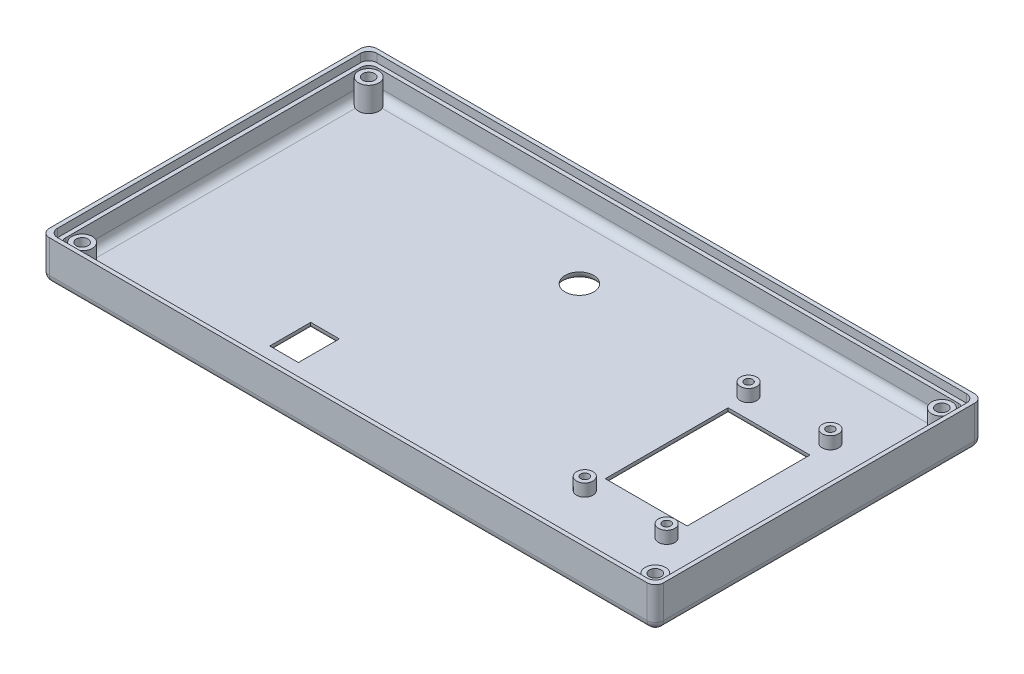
ISO-10303-21;
HEADER;
FILE_DESCRIPTION(('STEP AP214'),'2;1');
FILE_NAME('part.step','',(''),(''),'','','');
FILE_SCHEMA(('AUTOMOTIVE_DESIGN { 1 0 10303 214 1 1 1 1 }'));
ENDSEC;
DATA;
#1=APPLICATION_CONTEXT('core data for automotive mechanical design processes');
#2=APPLICATION_PROTOCOL_DEFINITION('international standard','automotive_design',2000,#1);
#3=PRODUCT_CONTEXT('',#1,'mechanical');
#4=PRODUCT('Part','Part','',(#3));
#5=PRODUCT_RELATED_PRODUCT_CATEGORY('part','',(#4));
#6=PRODUCT_DEFINITION_FORMATION('','',#4);
#7=PRODUCT_DEFINITION_CONTEXT('part definition',#1,'design');
#8=PRODUCT_DEFINITION('design','',#6,#7);
#9=PRODUCT_DEFINITION_SHAPE('','',#8);
#10=(LENGTH_UNIT() NAMED_UNIT(*) SI_UNIT(.MILLI.,.METRE.));
#11=(NAMED_UNIT(*) PLANE_ANGLE_UNIT() SI_UNIT($,.RADIAN.));
#12=(NAMED_UNIT(*) SI_UNIT($,.STERADIAN.) SOLID_ANGLE_UNIT());
#13=UNCERTAINTY_MEASURE_WITH_UNIT(LENGTH_MEASURE(1.E-05),#10,'distance_accuracy_value','');
#14=(GEOMETRIC_REPRESENTATION_CONTEXT(3) GLOBAL_UNCERTAINTY_ASSIGNED_CONTEXT((#13)) GLOBAL_UNIT_ASSIGNED_CONTEXT((#10,
#11,#12)) REPRESENTATION_CONTEXT('',''));
#15=CARTESIAN_POINT('',(0.,0.,0.));
#16=DIRECTION('',(0.,0.,1.));
#17=DIRECTION('',(1.,0.,0.));
#18=AXIS2_PLACEMENT_3D('',#15,#16,#17);
#19=CARTESIAN_POINT('',(75.,10.,-40.));
#20=DIRECTION('',(-1.,0.,0.));
#21=DIRECTION('',(0.,0.,1.));
#22=AXIS2_PLACEMENT_3D('',#19,#20,#21);
#23=PLANE('',#22);
#24=DIRECTION('',(0.,0.,-1.));
#25=VECTOR('',#24,1.);
#26=CARTESIAN_POINT('',(75.,10.,-40.));
#27=LINE('',#26,#25);
#28=CARTESIAN_POINT('',(75.,10.,38.));
#29=VERTEX_POINT('',#28);
#30=CARTESIAN_POINT('',(75.,10.,-38.));
#31=VERTEX_POINT('',#30);
#32=EDGE_CURVE('E448',#29,#31,#27,.T.);
#33=ORIENTED_EDGE('',*,*,#32,.F.);
#34=DIRECTION('',(0.,-1.,0.));
#35=VECTOR('',#34,1.);
#36=CARTESIAN_POINT('',(75.,10.,38.));
#37=LINE('',#36,#35);
#38=CARTESIAN_POINT('',(75.,2.,38.));
#39=VERTEX_POINT('',#38);
#40=EDGE_CURVE('E540',#29,#39,#37,.T.);
#41=ORIENTED_EDGE('',*,*,#40,.T.);
#42=DIRECTION('',(0.,0.,-1.));
#43=VECTOR('',#42,1.);
#44=CARTESIAN_POINT('',(75.,2.,-40.));
#45=LINE('',#44,#43);
#46=CARTESIAN_POINT('',(75.,2.,-38.));
#47=VERTEX_POINT('',#46);
#48=EDGE_CURVE('E537',#39,#47,#45,.T.);
#49=ORIENTED_EDGE('',*,*,#48,.T.);
#50=DIRECTION('',(0.,-1.,0.));
#51=VECTOR('',#50,1.);
#52=CARTESIAN_POINT('',(75.,10.,-38.));
#53=LINE('',#52,#51);
#54=EDGE_CURVE('E534',#47,#31,#53,.F.);
#55=ORIENTED_EDGE('',*,*,#54,.T.);
#56=EDGE_LOOP('',(#33,#41,#49,#55));
#57=FACE_BOUND('',#56,.T.);
#58=ADVANCED_FACE('F41',(#57),#23,.F.);
#59=CARTESIAN_POINT('',(-75.,10.,-40.));
#60=DIRECTION('',(0.,0.,1.));
#61=DIRECTION('',(1.,0.,0.));
#62=AXIS2_PLACEMENT_3D('',#59,#60,#61);
#63=PLANE('',#62);
#64=DIRECTION('',(-1.,0.,0.));
#65=VECTOR('',#64,1.);
#66=CARTESIAN_POINT('',(-75.,10.,-40.));
#67=LINE('',#66,#65);
#68=CARTESIAN_POINT('',(73.,10.,-40.));
#69=VERTEX_POINT('',#68);
#70=CARTESIAN_POINT('',(-73.,10.,-40.));
#71=VERTEX_POINT('',#70);
#72=EDGE_CURVE('E466',#69,#71,#67,.T.);
#73=ORIENTED_EDGE('',*,*,#72,.F.);
#74=DIRECTION('',(0.,-1.,0.));
#75=VECTOR('',#74,1.);
#76=CARTESIAN_POINT('',(73.,10.,-40.));
#77=LINE('',#76,#75);
#78=CARTESIAN_POINT('',(73.,2.,-40.));
#79=VERTEX_POINT('',#78);
#80=EDGE_CURVE('E500',#69,#79,#77,.T.);
#81=ORIENTED_EDGE('',*,*,#80,.T.);
#82=DIRECTION('',(-1.,0.,0.));
#83=VECTOR('',#82,1.);
#84=CARTESIAN_POINT('',(-75.,2.,-40.));
#85=LINE('',#84,#83);
#86=CARTESIAN_POINT('',(-73.,2.,-40.));
#87=VERTEX_POINT('',#86);
#88=EDGE_CURVE('E496',#79,#87,#85,.T.);
#89=ORIENTED_EDGE('',*,*,#88,.T.);
#90=DIRECTION('',(0.,-1.,0.));
#91=VECTOR('',#90,1.);
#92=CARTESIAN_POINT('',(-73.,10.,-40.));
#93=LINE('',#92,#91);
#94=EDGE_CURVE('E493',#87,#71,#93,.F.);
#95=ORIENTED_EDGE('',*,*,#94,.T.);
#96=EDGE_LOOP('',(#73,#81,#89,#95));
#97=FACE_BOUND('',#96,.T.);
#98=ADVANCED_FACE('F705',(#97),#63,.F.);
#99=CARTESIAN_POINT('',(-75.,10.,-40.));
#100=DIRECTION('',(1.,0.,0.));
#101=DIRECTION('',(0.,0.,-1.));
#102=AXIS2_PLACEMENT_3D('',#99,#100,#101);
#103=PLANE('',#102);
#104=DIRECTION('',(0.,0.,1.));
#105=VECTOR('',#104,1.);
#106=CARTESIAN_POINT('',(-75.,10.,-40.));
#107=LINE('',#106,#105);
#108=CARTESIAN_POINT('',(-75.,10.,-38.));
#109=VERTEX_POINT('',#108);
#110=CARTESIAN_POINT('',(-75.,10.,38.));
#111=VERTEX_POINT('',#110);
#112=EDGE_CURVE('E470',#109,#111,#107,.T.);
#113=ORIENTED_EDGE('',*,*,#112,.F.);
#114=DIRECTION('',(0.,-1.,0.));
#115=VECTOR('',#114,1.);
#116=CARTESIAN_POINT('',(-75.,10.,-38.));
#117=LINE('',#116,#115);
#118=CARTESIAN_POINT('',(-75.,2.,-38.));
#119=VERTEX_POINT('',#118);
#120=EDGE_CURVE('E522',#109,#119,#117,.T.);
#121=ORIENTED_EDGE('',*,*,#120,.T.);
#122=DIRECTION('',(0.,0.,1.));
#123=VECTOR('',#122,1.);
#124=CARTESIAN_POINT('',(-75.,2.,-40.));
#125=LINE('',#124,#123);
#126=CARTESIAN_POINT('',(-75.,2.,38.));
#127=VERTEX_POINT('',#126);
#128=EDGE_CURVE('E519',#119,#127,#125,.T.);
#129=ORIENTED_EDGE('',*,*,#128,.T.);
#130=DIRECTION('',(0.,-1.,0.));
#131=VECTOR('',#130,1.);
#132=CARTESIAN_POINT('',(-75.,10.,38.));
#133=LINE('',#132,#131);
#134=EDGE_CURVE('E516',#127,#111,#133,.F.);
#135=ORIENTED_EDGE('',*,*,#134,.T.);
#136=EDGE_LOOP('',(#113,#121,#129,#135));
#137=FACE_BOUND('',#136,.T.);
#138=ADVANCED_FACE('F711',(#137),#103,.F.);
#139=CARTESIAN_POINT('',(-75.,10.,40.));
#140=DIRECTION('',(0.,0.,-1.));
#141=DIRECTION('',(-1.,0.,0.));
#142=AXIS2_PLACEMENT_3D('',#139,#140,#141);
#143=PLANE('',#142);
#144=DIRECTION('',(1.,0.,0.));
#145=VECTOR('',#144,1.);
#146=CARTESIAN_POINT('',(-75.,2.,40.));
#147=LINE('',#146,#145);
#148=CARTESIAN_POINT('',(-73.,2.,40.));
#149=VERTEX_POINT('',#148);
#150=CARTESIAN_POINT('',(73.,2.,40.));
#151=VERTEX_POINT('',#150);
#152=EDGE_CURVE('E528',#149,#151,#147,.T.);
#153=ORIENTED_EDGE('',*,*,#152,.T.);
#154=DIRECTION('',(0.,-1.,0.));
#155=VECTOR('',#154,1.);
#156=CARTESIAN_POINT('',(73.,10.,40.));
#157=LINE('',#156,#155);
#158=CARTESIAN_POINT('',(73.,10.,40.));
#159=VERTEX_POINT('',#158);
#160=EDGE_CURVE('E531',#151,#159,#157,.F.);
#161=ORIENTED_EDGE('',*,*,#160,.T.);
#162=DIRECTION('',(1.,0.,0.));
#163=VECTOR('',#162,1.);
#164=CARTESIAN_POINT('',(-75.,10.,40.));
#165=LINE('',#164,#163);
#166=CARTESIAN_POINT('',(-73.,10.,40.));
#167=VERTEX_POINT('',#166);
#168=EDGE_CURVE('E474',#167,#159,#165,.T.);
#169=ORIENTED_EDGE('',*,*,#168,.F.);
#170=DIRECTION('',(0.,-1.,0.));
#171=VECTOR('',#170,1.);
#172=CARTESIAN_POINT('',(-73.,10.,40.));
#173=LINE('',#172,#171);
#174=EDGE_CURVE('E525',#167,#149,#173,.T.);
#175=ORIENTED_EDGE('',*,*,#174,.T.);
#176=EDGE_LOOP('',(#153,#161,#169,#175));
#177=FACE_BOUND('',#176,.T.);
#178=ADVANCED_FACE('F776',(#177),#143,.F.);
#179=CARTESIAN_POINT('',(0.,10.,0.));
#180=DIRECTION('',(0.,1.,0.));
#181=DIRECTION('',(0.,0.,1.));
#182=AXIS2_PLACEMENT_3D('',#179,#180,#181);
#183=PLANE('',#182);
#184=DIRECTION('',(0.,0.,-1.));
#185=VECTOR('',#184,1.);
#186=CARTESIAN_POINT('',(74.,10.,-39.));
#187=LINE('',#186,#185);
#188=CARTESIAN_POINT('',(74.,10.,37.));
#189=VERTEX_POINT('',#188);
#190=CARTESIAN_POINT('',(74.,10.,-37.));
#191=VERTEX_POINT('',#190);
#192=EDGE_CURVE('E430',#189,#191,#187,.T.);
#193=ORIENTED_EDGE('',*,*,#192,.F.);
#194=CARTESIAN_POINT('',(72.,10.,37.));
#195=DIRECTION('',(0.,1.,0.));
#196=DIRECTION('',(0.,0.,1.));
#197=AXIS2_PLACEMENT_3D('',#194,#195,#196);
#198=CIRCLE('',#197,2.);
#199=CARTESIAN_POINT('',(72.,10.,39.));
#200=VERTEX_POINT('',#199);
#201=EDGE_CURVE('E1166',#189,#200,#198,.F.);
#202=ORIENTED_EDGE('',*,*,#201,.T.);
#203=DIRECTION('',(1.,0.,0.));
#204=VECTOR('',#203,1.);
#205=CARTESIAN_POINT('',(-74.,10.,39.));
#206=LINE('',#205,#204);
#207=CARTESIAN_POINT('',(-72.,10.,39.));
#208=VERTEX_POINT('',#207);
#209=EDGE_CURVE('E436',#208,#200,#206,.T.);
#210=ORIENTED_EDGE('',*,*,#209,.F.);
#211=CARTESIAN_POINT('',(-72.,10.,37.));
#212=DIRECTION('',(0.,1.,0.));
#213=DIRECTION('',(0.,0.,1.));
#214=AXIS2_PLACEMENT_3D('',#211,#212,#213);
#215=CIRCLE('',#214,2.);
#216=CARTESIAN_POINT('',(-74.,10.,37.));
#217=VERTEX_POINT('',#216);
#218=EDGE_CURVE('E1158',#208,#217,#215,.F.);
#219=ORIENTED_EDGE('',*,*,#218,.T.);
#220=DIRECTION('',(0.,0.,1.));
#221=VECTOR('',#220,1.);
#222=CARTESIAN_POINT('',(-74.,10.,-39.));
#223=LINE('',#222,#221);
#224=CARTESIAN_POINT('',(-74.,10.,-37.));
#225=VERTEX_POINT('',#224);
#226=EDGE_CURVE('E456',#225,#217,#223,.T.);
#227=ORIENTED_EDGE('',*,*,#226,.F.);
#228=CARTESIAN_POINT('',(-72.,10.,-37.));
#229=DIRECTION('',(0.,1.,0.));
#230=DIRECTION('',(0.,0.,1.));
#231=AXIS2_PLACEMENT_3D('',#228,#229,#230);
#232=CIRCLE('',#231,2.);
#233=CARTESIAN_POINT('',(-72.,10.,-39.));
#234=VERTEX_POINT('',#233);
#235=EDGE_CURVE('E1176',#225,#234,#232,.F.);
#236=ORIENTED_EDGE('',*,*,#235,.T.);
#237=DIRECTION('',(-1.,0.,0.));
#238=VECTOR('',#237,1.);
#239=CARTESIAN_POINT('',(-74.,10.,-39.));
#240=LINE('',#239,#238);
#241=CARTESIAN_POINT('',(72.,10.,-39.));
#242=VERTEX_POINT('',#241);
#243=EDGE_CURVE('E452',#242,#234,#240,.T.);
#244=ORIENTED_EDGE('',*,*,#243,.F.);
#245=CARTESIAN_POINT('',(72.,10.,-37.));
#246=DIRECTION('',(0.,1.,0.));
#247=DIRECTION('',(0.,0.,1.));
#248=AXIS2_PLACEMENT_3D('',#245,#246,#247);
#249=CIRCLE('',#248,2.);
#250=EDGE_CURVE('E1172',#242,#191,#249,.F.);
#251=ORIENTED_EDGE('',*,*,#250,.T.);
#252=EDGE_LOOP('',(#193,#202,#210,#219,#227,#236,#244,#251));
#253=FACE_BOUND('',#252,.T.);
#254=ORIENTED_EDGE('',*,*,#168,.T.);
#255=CARTESIAN_POINT('',(73.,10.,38.));
#256=DIRECTION('',(0.,1.,0.));
#257=DIRECTION('',(0.,0.,1.));
#258=AXIS2_PLACEMENT_3D('',#255,#256,#257);
#259=CIRCLE('',#258,2.);
#260=EDGE_CURVE('E552',#159,#29,#259,.T.);
#261=ORIENTED_EDGE('',*,*,#260,.T.);
#262=ORIENTED_EDGE('',*,*,#32,.T.);
#263=CARTESIAN_POINT('',(73.,10.,-38.));
#264=DIRECTION('',(0.,1.,0.));
#265=DIRECTION('',(0.,0.,1.));
#266=AXIS2_PLACEMENT_3D('',#263,#264,#265);
#267=CIRCLE('',#266,2.);
#268=EDGE_CURVE('E549',#31,#69,#267,.T.);
#269=ORIENTED_EDGE('',*,*,#268,.T.);
#270=ORIENTED_EDGE('',*,*,#72,.T.);
#271=CARTESIAN_POINT('',(-73.,10.,-38.));
#272=DIRECTION('',(0.,1.,0.));
#273=DIRECTION('',(0.,0.,1.));
#274=AXIS2_PLACEMENT_3D('',#271,#272,#273);
#275=CIRCLE('',#274,2.);
#276=EDGE_CURVE('E546',#71,#109,#275,.T.);
#277=ORIENTED_EDGE('',*,*,#276,.T.);
#278=ORIENTED_EDGE('',*,*,#112,.T.);
#279=CARTESIAN_POINT('',(-73.,10.,38.));
#280=DIRECTION('',(0.,1.,0.));
#281=DIRECTION('',(0.,0.,1.));
#282=AXIS2_PLACEMENT_3D('',#279,#280,#281);
#283=CIRCLE('',#282,2.);
#284=EDGE_CURVE('E543',#111,#167,#283,.T.);
#285=ORIENTED_EDGE('',*,*,#284,.T.);
#286=EDGE_LOOP('',(#254,#261,#262,#269,#270,#277,#278,#285));
#287=FACE_BOUND('',#286,.T.);
#288=ADVANCED_FACE('F772',(#253,#287),#183,.T.);
#289=CARTESIAN_POINT('',(0.,0.,0.));
#290=DIRECTION('',(0.,1.,0.));
#291=DIRECTION('',(0.,0.,1.));
#292=AXIS2_PLACEMENT_3D('',#289,#290,#291);
#293=PLANE('',#292);
#294=DIRECTION('',(-1.,0.,0.));
#295=VECTOR('',#294,1.);
#296=CARTESIAN_POINT('',(0.,0.,16.));
#297=LINE('',#296,#295);
#298=CARTESIAN_POINT('',(-22.1722086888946,0.,16.));
#299=VERTEX_POINT('',#298);
#300=CARTESIAN_POINT('',(-33.1722086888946,0.,16.));
#301=VERTEX_POINT('',#300);
#302=EDGE_CURVE('E962',#299,#301,#297,.T.);
#303=ORIENTED_EDGE('',*,*,#302,.T.);
#304=DIRECTION('',(0.,0.,1.));
#305=VECTOR('',#304,1.);
#306=CARTESIAN_POINT('',(-33.1722086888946,0.,0.));
#307=LINE('',#306,#305);
#308=CARTESIAN_POINT('',(-33.1722086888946,0.,30.));
#309=VERTEX_POINT('',#308);
#310=EDGE_CURVE('E11',#301,#309,#307,.T.);
#311=ORIENTED_EDGE('',*,*,#310,.T.);
#312=DIRECTION('',(1.,0.,0.));
#313=VECTOR('',#312,1.);
#314=CARTESIAN_POINT('',(0.,0.,30.));
#315=LINE('',#314,#313);
#316=CARTESIAN_POINT('',(-22.1722086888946,0.,30.));
#317=VERTEX_POINT('',#316);
#318=EDGE_CURVE('E51',#309,#317,#315,.T.);
#319=ORIENTED_EDGE('',*,*,#318,.T.);
#320=DIRECTION('',(0.,0.,-1.));
#321=VECTOR('',#320,1.);
#322=CARTESIAN_POINT('',(-22.1722086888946,0.,0.));
#323=LINE('',#322,#321);
#324=EDGE_CURVE('E329',#317,#299,#323,.T.);
#325=ORIENTED_EDGE('',*,*,#324,.T.);
#326=EDGE_LOOP('',(#303,#311,#319,#325));
#327=FACE_BOUND('',#326,.T.);
#328=CARTESIAN_POINT('',(-6.53585003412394,0.,-23.));
#329=DIRECTION('',(0.,1.,0.));
#330=DIRECTION('',(0.,0.,1.));
#331=AXIS2_PLACEMENT_3D('',#328,#329,#330);
#332=CIRCLE('',#331,5.5);
#333=CARTESIAN_POINT('',(-6.53585003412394,0.,-17.5));
#334=VERTEX_POINT('',#333);
#335=EDGE_CURVE('E958',#334,#334,#332,.T.);
#336=ORIENTED_EDGE('',*,*,#335,.T.);
#337=EDGE_LOOP('',(#336));
#338=FACE_BOUND('',#337,.T.);
#339=DIRECTION('',(0.,0.,1.));
#340=VECTOR('',#339,1.);
#341=CARTESIAN_POINT('',(35.8764481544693,0.,0.));
#342=LINE('',#341,#340);
#343=CARTESIAN_POINT('',(35.8764481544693,0.,-16.9013428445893));
#344=VERTEX_POINT('',#343);
#345=CARTESIAN_POINT('',(35.8764481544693,0.,17.0986571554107));
#346=VERTEX_POINT('',#345);
#347=EDGE_CURVE('E945',#344,#346,#342,.T.);
#348=ORIENTED_EDGE('',*,*,#347,.T.);
#349=DIRECTION('',(1.,0.,0.));
#350=VECTOR('',#349,1.);
#351=CARTESIAN_POINT('',(0.,0.,17.0986571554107));
#352=LINE('',#351,#350);
#353=CARTESIAN_POINT('',(59.8764481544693,0.,17.0986571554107));
#354=VERTEX_POINT('',#353);
#355=EDGE_CURVE('E954',#346,#354,#352,.T.);
#356=ORIENTED_EDGE('',*,*,#355,.T.);
#357=DIRECTION('',(0.,0.,-1.));
#358=VECTOR('',#357,1.);
#359=CARTESIAN_POINT('',(59.8764481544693,0.,0.));
#360=LINE('',#359,#358);
#361=CARTESIAN_POINT('',(59.8764481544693,0.,-16.9013428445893));
#362=VERTEX_POINT('',#361);
#363=EDGE_CURVE('E951',#354,#362,#360,.T.);
#364=ORIENTED_EDGE('',*,*,#363,.T.);
#365=DIRECTION('',(-1.,0.,0.));
#366=VECTOR('',#365,1.);
#367=CARTESIAN_POINT('',(0.,0.,-16.9013428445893));
#368=LINE('',#367,#366);
#369=EDGE_CURVE('E948',#362,#344,#368,.T.);
#370=ORIENTED_EDGE('',*,*,#369,.T.);
#371=EDGE_LOOP('',(#348,#356,#364,#370));
#372=FACE_BOUND('',#371,.T.);
#373=DIRECTION('',(0.,0.,1.));
#374=VECTOR('',#373,1.);
#375=CARTESIAN_POINT('',(-73.,0.,0.));
#376=LINE('',#375,#374);
#377=CARTESIAN_POINT('',(-73.,0.,38.));
#378=VERTEX_POINT('',#377);
#379=CARTESIAN_POINT('',(-73.,0.,-38.));
#380=VERTEX_POINT('',#379);
#381=EDGE_CURVE('E509',#378,#380,#376,.F.);
#382=ORIENTED_EDGE('',*,*,#381,.T.);
#383=DIRECTION('',(-1.,0.,0.));
#384=VECTOR('',#383,1.);
#385=CARTESIAN_POINT('',(0.,0.,-38.));
#386=LINE('',#385,#384);
#387=CARTESIAN_POINT('',(73.,0.,-38.));
#388=VERTEX_POINT('',#387);
#389=EDGE_CURVE('E512',#380,#388,#386,.F.);
#390=ORIENTED_EDGE('',*,*,#389,.T.);
#391=DIRECTION('',(0.,0.,-1.));
#392=VECTOR('',#391,1.);
#393=CARTESIAN_POINT('',(73.,0.,0.));
#394=LINE('',#393,#392);
#395=CARTESIAN_POINT('',(73.,0.,38.));
#396=VERTEX_POINT('',#395);
#397=EDGE_CURVE('E503',#388,#396,#394,.F.);
#398=ORIENTED_EDGE('',*,*,#397,.T.);
#399=DIRECTION('',(1.,0.,0.));
#400=VECTOR('',#399,1.);
#401=CARTESIAN_POINT('',(0.,0.,38.));
#402=LINE('',#401,#400);
#403=EDGE_CURVE('E506',#396,#378,#402,.F.);
#404=ORIENTED_EDGE('',*,*,#403,.T.);
#405=EDGE_LOOP('',(#382,#390,#398,#404));
#406=FACE_BOUND('',#405,.T.);
#407=ADVANCED_FACE('F997',(#327,#338,#372,#406),#293,.F.);
#408=CARTESIAN_POINT('',(74.,8.,-39.));
#409=DIRECTION('',(1.,0.,0.));
#410=DIRECTION('',(0.,0.,-1.));
#411=AXIS2_PLACEMENT_3D('',#408,#409,#410);
#412=PLANE('',#411);
#413=DIRECTION('',(0.,0.,-1.));
#414=VECTOR('',#413,1.);
#415=CARTESIAN_POINT('',(74.,8.,-39.));
#416=LINE('',#415,#414);
#417=CARTESIAN_POINT('',(74.,8.,37.));
#418=VERTEX_POINT('',#417);
#419=CARTESIAN_POINT('',(74.,8.,-37.));
#420=VERTEX_POINT('',#419);
#421=EDGE_CURVE('E431',#418,#420,#416,.T.);
#422=ORIENTED_EDGE('',*,*,#421,.F.);
#423=DIRECTION('',(0.,1.,0.));
#424=VECTOR('',#423,1.);
#425=CARTESIAN_POINT('',(74.,10.,37.));
#426=LINE('',#425,#424);
#427=EDGE_CURVE('E1214',#418,#189,#426,.T.);
#428=ORIENTED_EDGE('',*,*,#427,.T.);
#429=ORIENTED_EDGE('',*,*,#192,.T.);
#430=DIRECTION('',(0.,1.,0.));
#431=VECTOR('',#430,1.);
#432=CARTESIAN_POINT('',(74.,8.,-37.));
#433=LINE('',#432,#431);
#434=EDGE_CURVE('E1227',#191,#420,#433,.F.);
#435=ORIENTED_EDGE('',*,*,#434,.T.);
#436=EDGE_LOOP('',(#422,#428,#429,#435));
#437=FACE_BOUND('',#436,.T.);
#438=ADVANCED_FACE('F1000',(#437),#412,.F.);
#439=CARTESIAN_POINT('',(-74.,8.,39.));
#440=DIRECTION('',(0.,0.,1.));
#441=DIRECTION('',(1.,0.,0.));
#442=AXIS2_PLACEMENT_3D('',#439,#440,#441);
#443=PLANE('',#442);
#444=DIRECTION('',(1.,0.,0.));
#445=VECTOR('',#444,1.);
#446=CARTESIAN_POINT('',(-74.,8.,39.));
#447=LINE('',#446,#445);
#448=CARTESIAN_POINT('',(-72.,8.,39.));
#449=VERTEX_POINT('',#448);
#450=CARTESIAN_POINT('',(72.,8.,39.));
#451=VERTEX_POINT('',#450);
#452=EDGE_CURVE('E444',#449,#451,#447,.T.);
#453=ORIENTED_EDGE('',*,*,#452,.F.);
#454=DIRECTION('',(0.,1.,0.));
#455=VECTOR('',#454,1.);
#456=CARTESIAN_POINT('',(-72.,10.,39.));
#457=LINE('',#456,#455);
#458=EDGE_CURVE('E1251',#449,#208,#457,.T.);
#459=ORIENTED_EDGE('',*,*,#458,.T.);
#460=ORIENTED_EDGE('',*,*,#209,.T.);
#461=DIRECTION('',(0.,1.,0.));
#462=VECTOR('',#461,1.);
#463=CARTESIAN_POINT('',(72.,8.,39.));
#464=LINE('',#463,#462);
#465=EDGE_CURVE('E636',#200,#451,#464,.F.);
#466=ORIENTED_EDGE('',*,*,#465,.T.);
#467=EDGE_LOOP('',(#453,#459,#460,#466));
#468=FACE_BOUND('',#467,.T.);
#469=ADVANCED_FACE('F1062',(#468),#443,.F.);
#470=CARTESIAN_POINT('',(-74.,8.,-39.));
#471=DIRECTION('',(-1.,0.,0.));
#472=DIRECTION('',(0.,0.,1.));
#473=AXIS2_PLACEMENT_3D('',#470,#471,#472);
#474=PLANE('',#473);
#475=ORIENTED_EDGE('',*,*,#226,.T.);
#476=DIRECTION('',(0.,1.,0.));
#477=VECTOR('',#476,1.);
#478=CARTESIAN_POINT('',(-74.,8.,37.));
#479=LINE('',#478,#477);
#480=CARTESIAN_POINT('',(-74.,8.,37.));
#481=VERTEX_POINT('',#480);
#482=EDGE_CURVE('E1245',#217,#481,#479,.F.);
#483=ORIENTED_EDGE('',*,*,#482,.T.);
#484=DIRECTION('',(0.,0.,1.));
#485=VECTOR('',#484,1.);
#486=CARTESIAN_POINT('',(-74.,8.,-39.));
#487=LINE('',#486,#485);
#488=CARTESIAN_POINT('',(-74.,8.,-37.));
#489=VERTEX_POINT('',#488);
#490=EDGE_CURVE('E440',#489,#481,#487,.T.);
#491=ORIENTED_EDGE('',*,*,#490,.F.);
#492=DIRECTION('',(0.,1.,0.));
#493=VECTOR('',#492,1.);
#494=CARTESIAN_POINT('',(-74.,10.,-37.));
#495=LINE('',#494,#493);
#496=EDGE_CURVE('E1248',#489,#225,#495,.T.);
#497=ORIENTED_EDGE('',*,*,#496,.T.);
#498=EDGE_LOOP('',(#475,#483,#491,#497));
#499=FACE_BOUND('',#498,.T.);
#500=ADVANCED_FACE('F1068',(#499),#474,.F.);
#501=CARTESIAN_POINT('',(-74.,8.,-39.));
#502=DIRECTION('',(0.,0.,-1.));
#503=DIRECTION('',(-1.,0.,0.));
#504=AXIS2_PLACEMENT_3D('',#501,#502,#503);
#505=PLANE('',#504);
#506=DIRECTION('',(-1.,0.,0.));
#507=VECTOR('',#506,1.);
#508=CARTESIAN_POINT('',(-74.,8.,-39.));
#509=LINE('',#508,#507);
#510=CARTESIAN_POINT('',(72.,8.,-39.));
#511=VERTEX_POINT('',#510);
#512=CARTESIAN_POINT('',(-72.,8.,-39.));
#513=VERTEX_POINT('',#512);
#514=EDGE_CURVE('E435',#511,#513,#509,.T.);
#515=ORIENTED_EDGE('',*,*,#514,.F.);
#516=DIRECTION('',(0.,1.,0.));
#517=VECTOR('',#516,1.);
#518=CARTESIAN_POINT('',(72.,10.,-39.));
#519=LINE('',#518,#517);
#520=EDGE_CURVE('E1160',#511,#242,#519,.T.);
#521=ORIENTED_EDGE('',*,*,#520,.T.);
#522=ORIENTED_EDGE('',*,*,#243,.T.);
#523=DIRECTION('',(0.,1.,0.));
#524=VECTOR('',#523,1.);
#525=CARTESIAN_POINT('',(-72.,8.,-39.));
#526=LINE('',#525,#524);
#527=EDGE_CURVE('E1209',#234,#513,#526,.F.);
#528=ORIENTED_EDGE('',*,*,#527,.T.);
#529=EDGE_LOOP('',(#515,#521,#522,#528));
#530=FACE_BOUND('',#529,.T.);
#531=ADVANCED_FACE('F1064',(#530),#505,.F.);
#532=CARTESIAN_POINT('',(0.,8.,0.));
#533=DIRECTION('',(0.,1.,0.));
#534=DIRECTION('',(0.,0.,1.));
#535=AXIS2_PLACEMENT_3D('',#532,#533,#534);
#536=PLANE('',#535);
#537=DIRECTION('',(0.,0.,-1.));
#538=VECTOR('',#537,1.);
#539=CARTESIAN_POINT('',(73.,8.,-38.));
#540=LINE('',#539,#538);
#541=CARTESIAN_POINT('',(73.,8.,36.));
#542=VERTEX_POINT('',#541);
#543=CARTESIAN_POINT('',(73.,8.,-36.));
#544=VERTEX_POINT('',#543);
#545=EDGE_CURVE('E414',#542,#544,#540,.T.);
#546=ORIENTED_EDGE('',*,*,#545,.F.);
#547=CARTESIAN_POINT('',(71.,8.,36.));
#548=DIRECTION('',(0.,1.,0.));
#549=DIRECTION('',(0.,0.,1.));
#550=AXIS2_PLACEMENT_3D('',#547,#548,#549);
#551=CIRCLE('',#550,2.);
#552=CARTESIAN_POINT('',(71.,8.,38.));
#553=VERTEX_POINT('',#552);
#554=EDGE_CURVE('E1169',#542,#553,#551,.F.);
#555=ORIENTED_EDGE('',*,*,#554,.T.);
#556=DIRECTION('',(1.,0.,0.));
#557=VECTOR('',#556,1.);
#558=CARTESIAN_POINT('',(-73.,8.,38.));
#559=LINE('',#558,#557);
#560=CARTESIAN_POINT('',(-71.,8.,38.));
#561=VERTEX_POINT('',#560);
#562=EDGE_CURVE('E426',#561,#553,#559,.T.);
#563=ORIENTED_EDGE('',*,*,#562,.F.);
#564=CARTESIAN_POINT('',(-71.,8.,36.));
#565=DIRECTION('',(0.,1.,0.));
#566=DIRECTION('',(0.,0.,1.));
#567=AXIS2_PLACEMENT_3D('',#564,#565,#566);
#568=CIRCLE('',#567,2.);
#569=CARTESIAN_POINT('',(-73.,8.,36.));
#570=VERTEX_POINT('',#569);
#571=EDGE_CURVE('E1153',#561,#570,#568,.F.);
#572=ORIENTED_EDGE('',*,*,#571,.T.);
#573=DIRECTION('',(0.,0.,1.));
#574=VECTOR('',#573,1.);
#575=CARTESIAN_POINT('',(-73.,8.,-38.));
#576=LINE('',#575,#574);
#577=CARTESIAN_POINT('',(-73.,8.,-36.));
#578=VERTEX_POINT('',#577);
#579=EDGE_CURVE('E422',#578,#570,#576,.T.);
#580=ORIENTED_EDGE('',*,*,#579,.F.);
#581=CARTESIAN_POINT('',(-71.,8.,-36.));
#582=DIRECTION('',(0.,1.,0.));
#583=DIRECTION('',(0.,0.,1.));
#584=AXIS2_PLACEMENT_3D('',#581,#582,#583);
#585=CIRCLE('',#584,2.);
#586=CARTESIAN_POINT('',(-71.,8.,-38.));
#587=VERTEX_POINT('',#586);
#588=EDGE_CURVE('E932',#578,#587,#585,.F.);
#589=ORIENTED_EDGE('',*,*,#588,.T.);
#590=DIRECTION('',(-1.,0.,0.));
#591=VECTOR('',#590,1.);
#592=CARTESIAN_POINT('',(-73.,8.,-38.));
#593=LINE('',#592,#591);
#594=CARTESIAN_POINT('',(71.,8.,-38.));
#595=VERTEX_POINT('',#594);
#596=EDGE_CURVE('E418',#595,#587,#593,.T.);
#597=ORIENTED_EDGE('',*,*,#596,.F.);
#598=CARTESIAN_POINT('',(71.,8.,-36.));
#599=DIRECTION('',(0.,1.,0.));
#600=DIRECTION('',(0.,0.,1.));
#601=AXIS2_PLACEMENT_3D('',#598,#599,#600);
#602=CIRCLE('',#601,2.);
#603=EDGE_CURVE('E1150',#595,#544,#602,.F.);
#604=ORIENTED_EDGE('',*,*,#603,.T.);
#605=EDGE_LOOP('',(#546,#555,#563,#572,#580,#589,#597,#604));
#606=FACE_BOUND('',#605,.T.);
#607=ORIENTED_EDGE('',*,*,#490,.T.);
#608=CARTESIAN_POINT('',(-72.,8.,37.));
#609=DIRECTION('',(0.,1.,0.));
#610=DIRECTION('',(0.,0.,1.));
#611=AXIS2_PLACEMENT_3D('',#608,#609,#610);
#612=CIRCLE('',#611,2.);
#613=EDGE_CURVE('E1231',#481,#449,#612,.T.);
#614=ORIENTED_EDGE('',*,*,#613,.T.);
#615=ORIENTED_EDGE('',*,*,#452,.T.);
#616=CARTESIAN_POINT('',(72.,8.,37.));
#617=DIRECTION('',(0.,1.,0.));
#618=DIRECTION('',(0.,0.,1.));
#619=AXIS2_PLACEMENT_3D('',#616,#617,#618);
#620=CIRCLE('',#619,2.);
#621=EDGE_CURVE('E1235',#451,#418,#620,.T.);
#622=ORIENTED_EDGE('',*,*,#621,.T.);
#623=ORIENTED_EDGE('',*,*,#421,.T.);
#624=CARTESIAN_POINT('',(72.,8.,-37.));
#625=DIRECTION('',(0.,1.,0.));
#626=DIRECTION('',(0.,0.,1.));
#627=AXIS2_PLACEMENT_3D('',#624,#625,#626);
#628=CIRCLE('',#627,2.);
#629=EDGE_CURVE('E1229',#420,#511,#628,.T.);
#630=ORIENTED_EDGE('',*,*,#629,.T.);
#631=ORIENTED_EDGE('',*,*,#514,.T.);
#632=CARTESIAN_POINT('',(-72.,8.,-37.));
#633=DIRECTION('',(0.,1.,0.));
#634=DIRECTION('',(0.,0.,1.));
#635=AXIS2_PLACEMENT_3D('',#632,#633,#634);
#636=CIRCLE('',#635,2.);
#637=EDGE_CURVE('E1242',#513,#489,#636,.T.);
#638=ORIENTED_EDGE('',*,*,#637,.T.);
#639=EDGE_LOOP('',(#607,#614,#615,#622,#623,#630,#631,#638));
#640=FACE_BOUND('',#639,.T.);
#641=ADVANCED_FACE('F1067',(#606,#640),#536,.T.);
#642=CARTESIAN_POINT('',(73.,2.,-38.));
#643=DIRECTION('',(1.,0.,0.));
#644=DIRECTION('',(0.,0.,-1.));
#645=AXIS2_PLACEMENT_3D('',#642,#643,#644);
#646=PLANE('',#645);
#647=DIRECTION('',(0.,0.,-1.));
#648=VECTOR('',#647,1.);
#649=CARTESIAN_POINT('',(73.,4.,-38.));
#650=LINE('',#649,#648);
#651=CARTESIAN_POINT('',(73.,4.,-36.));
#652=VERTEX_POINT('',#651);
#653=CARTESIAN_POINT('',(73.,4.,36.));
#654=VERTEX_POINT('',#653);
#655=EDGE_CURVE('E899',#652,#654,#650,.F.);
#656=ORIENTED_EDGE('',*,*,#655,.T.);
#657=DIRECTION('',(0.,1.,0.));
#658=VECTOR('',#657,1.);
#659=CARTESIAN_POINT('',(73.,8.,36.));
#660=LINE('',#659,#658);
#661=EDGE_CURVE('E1204',#654,#542,#660,.T.);
#662=ORIENTED_EDGE('',*,*,#661,.T.);
#663=ORIENTED_EDGE('',*,*,#545,.T.);
#664=DIRECTION('',(0.,1.,0.));
#665=VECTOR('',#664,1.);
#666=CARTESIAN_POINT('',(73.,4.,-36.));
#667=LINE('',#666,#665);
#668=EDGE_CURVE('E1205',#544,#652,#667,.F.);
#669=ORIENTED_EDGE('',*,*,#668,.T.);
#670=EDGE_LOOP('',(#656,#662,#663,#669));
#671=FACE_BOUND('',#670,.T.);
#672=ADVANCED_FACE('F1078',(#671),#646,.F.);
#673=CARTESIAN_POINT('',(-73.,2.,38.));
#674=DIRECTION('',(0.,0.,1.));
#675=DIRECTION('',(1.,0.,0.));
#676=AXIS2_PLACEMENT_3D('',#673,#674,#675);
#677=PLANE('',#676);
#678=DIRECTION('',(1.,0.,0.));
#679=VECTOR('',#678,1.);
#680=CARTESIAN_POINT('',(-73.,4.,38.));
#681=LINE('',#680,#679);
#682=CARTESIAN_POINT('',(71.,4.,38.));
#683=VERTEX_POINT('',#682);
#684=CARTESIAN_POINT('',(-71.,4.,38.));
#685=VERTEX_POINT('',#684);
#686=EDGE_CURVE('E804',#683,#685,#681,.F.);
#687=ORIENTED_EDGE('',*,*,#686,.T.);
#688=DIRECTION('',(0.,1.,0.));
#689=VECTOR('',#688,1.);
#690=CARTESIAN_POINT('',(-71.,8.,38.));
#691=LINE('',#690,#689);
#692=EDGE_CURVE('E808',#685,#561,#691,.T.);
#693=ORIENTED_EDGE('',*,*,#692,.T.);
#694=ORIENTED_EDGE('',*,*,#562,.T.);
#695=DIRECTION('',(0.,1.,0.));
#696=VECTOR('',#695,1.);
#697=CARTESIAN_POINT('',(71.,4.,38.));
#698=LINE('',#697,#696);
#699=EDGE_CURVE('E801',#553,#683,#698,.F.);
#700=ORIENTED_EDGE('',*,*,#699,.T.);
#701=EDGE_LOOP('',(#687,#693,#694,#700));
#702=FACE_BOUND('',#701,.T.);
#703=ADVANCED_FACE('F1082',(#702),#677,.F.);
#704=CARTESIAN_POINT('',(-73.,2.,-38.));
#705=DIRECTION('',(-1.,0.,0.));
#706=DIRECTION('',(0.,0.,1.));
#707=AXIS2_PLACEMENT_3D('',#704,#705,#706);
#708=PLANE('',#707);
#709=ORIENTED_EDGE('',*,*,#579,.T.);
#710=DIRECTION('',(0.,1.,0.));
#711=VECTOR('',#710,1.);
#712=CARTESIAN_POINT('',(-73.,4.,36.));
#713=LINE('',#712,#711);
#714=CARTESIAN_POINT('',(-73.,4.,36.));
#715=VERTEX_POINT('',#714);
#716=EDGE_CURVE('E815',#570,#715,#713,.F.);
#717=ORIENTED_EDGE('',*,*,#716,.T.);
#718=DIRECTION('',(0.,0.,1.));
#719=VECTOR('',#718,1.);
#720=CARTESIAN_POINT('',(-73.,4.,-38.));
#721=LINE('',#720,#719);
#722=CARTESIAN_POINT('',(-73.,4.,-36.));
#723=VERTEX_POINT('',#722);
#724=EDGE_CURVE('E575',#715,#723,#721,.F.);
#725=ORIENTED_EDGE('',*,*,#724,.T.);
#726=DIRECTION('',(0.,1.,0.));
#727=VECTOR('',#726,1.);
#728=CARTESIAN_POINT('',(-73.,8.,-36.));
#729=LINE('',#728,#727);
#730=EDGE_CURVE('E812',#723,#578,#729,.T.);
#731=ORIENTED_EDGE('',*,*,#730,.T.);
#732=EDGE_LOOP('',(#709,#717,#725,#731));
#733=FACE_BOUND('',#732,.T.);
#734=ADVANCED_FACE('F1087',(#733),#708,.F.);
#735=CARTESIAN_POINT('',(-73.,2.,-38.));
#736=DIRECTION('',(0.,0.,-1.));
#737=DIRECTION('',(-1.,0.,0.));
#738=AXIS2_PLACEMENT_3D('',#735,#736,#737);
#739=PLANE('',#738);
#740=DIRECTION('',(-1.,0.,0.));
#741=VECTOR('',#740,1.);
#742=CARTESIAN_POINT('',(-73.,4.,-38.));
#743=LINE('',#742,#741);
#744=CARTESIAN_POINT('',(-71.,4.,-38.));
#745=VERTEX_POINT('',#744);
#746=CARTESIAN_POINT('',(71.,4.,-38.));
#747=VERTEX_POINT('',#746);
#748=EDGE_CURVE('E805',#745,#747,#743,.F.);
#749=ORIENTED_EDGE('',*,*,#748,.T.);
#750=DIRECTION('',(0.,1.,0.));
#751=VECTOR('',#750,1.);
#752=CARTESIAN_POINT('',(71.,8.,-38.));
#753=LINE('',#752,#751);
#754=EDGE_CURVE('E1149',#747,#595,#753,.T.);
#755=ORIENTED_EDGE('',*,*,#754,.T.);
#756=ORIENTED_EDGE('',*,*,#596,.T.);
#757=DIRECTION('',(0.,1.,0.));
#758=VECTOR('',#757,1.);
#759=CARTESIAN_POINT('',(-71.,4.,-38.));
#760=LINE('',#759,#758);
#761=EDGE_CURVE('E1154',#587,#745,#760,.F.);
#762=ORIENTED_EDGE('',*,*,#761,.T.);
#763=EDGE_LOOP('',(#749,#755,#756,#762));
#764=FACE_BOUND('',#763,.T.);
#765=ADVANCED_FACE('F1084',(#764),#739,.F.);
#766=CARTESIAN_POINT('',(0.,2.,0.));
#767=DIRECTION('',(0.,1.,0.));
#768=DIRECTION('',(0.,0.,1.));
#769=AXIS2_PLACEMENT_3D('',#766,#767,#768);
#770=PLANE('',#769);
#771=CARTESIAN_POINT('',(37.8764481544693,2.,20.0986571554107));
#772=DIRECTION('',(0.,1.,0.));
#773=DIRECTION('',(0.,0.,-1.));
#774=AXIS2_PLACEMENT_3D('',#771,#772,#773);
#775=CIRCLE('',#774,2.);
#776=CARTESIAN_POINT('',(37.8764481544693,2.,18.0986571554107));
#777=VERTEX_POINT('',#776);
#778=EDGE_CURVE('E1905',#777,#777,#775,.T.);
#779=ORIENTED_EDGE('',*,*,#778,.F.);
#780=EDGE_LOOP('',(#779));
#781=FACE_BOUND('',#780,.T.);
#782=CARTESIAN_POINT('',(57.8764481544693,2.,20.0986571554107));
#783=DIRECTION('',(0.,1.,0.));
#784=DIRECTION('',(0.,0.,1.));
#785=AXIS2_PLACEMENT_3D('',#782,#783,#784);
#786=CIRCLE('',#785,2.);
#787=CARTESIAN_POINT('',(57.8764481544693,2.,22.0986571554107));
#788=VERTEX_POINT('',#787);
#789=EDGE_CURVE('E1922',#788,#788,#786,.T.);
#790=ORIENTED_EDGE('',*,*,#789,.F.);
#791=EDGE_LOOP('',(#790));
#792=FACE_BOUND('',#791,.T.);
#793=CARTESIAN_POINT('',(57.8764481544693,2.,-19.9013428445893));
#794=DIRECTION('',(0.,1.,0.));
#795=DIRECTION('',(0.,0.,-1.));
#796=AXIS2_PLACEMENT_3D('',#793,#794,#795);
#797=CIRCLE('',#796,2.);
#798=CARTESIAN_POINT('',(57.8764481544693,2.,-21.9013428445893));
#799=VERTEX_POINT('',#798);
#800=EDGE_CURVE('E1928',#799,#799,#797,.T.);
#801=ORIENTED_EDGE('',*,*,#800,.F.);
#802=EDGE_LOOP('',(#801));
#803=FACE_BOUND('',#802,.T.);
#804=CARTESIAN_POINT('',(37.8764481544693,2.,-19.9013428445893));
#805=DIRECTION('',(0.,1.,0.));
#806=DIRECTION('',(0.,0.,1.));
#807=AXIS2_PLACEMENT_3D('',#804,#805,#806);
#808=CIRCLE('',#807,2.);
#809=CARTESIAN_POINT('',(37.8764481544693,2.,-17.9013428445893));
#810=VERTEX_POINT('',#809);
#811=EDGE_CURVE('E1936',#810,#810,#808,.T.);
#812=ORIENTED_EDGE('',*,*,#811,.F.);
#813=EDGE_LOOP('',(#812));
#814=FACE_BOUND('',#813,.T.);
#815=DIRECTION('',(0.,0.,1.));
#816=VECTOR('',#815,1.);
#817=CARTESIAN_POINT('',(-31.1722086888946,2.,18.));
#818=LINE('',#817,#816);
#819=CARTESIAN_POINT('',(-31.1722086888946,2.,18.));
#820=VERTEX_POINT('',#819);
#821=CARTESIAN_POINT('',(-31.1722086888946,2.,28.));
#822=VERTEX_POINT('',#821);
#823=EDGE_CURVE('E337',#820,#822,#818,.T.);
#824=ORIENTED_EDGE('',*,*,#823,.F.);
#825=DIRECTION('',(-1.,0.,0.));
#826=VECTOR('',#825,1.);
#827=CARTESIAN_POINT('',(-31.1722086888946,2.,18.));
#828=LINE('',#827,#826);
#829=CARTESIAN_POINT('',(-24.1722086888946,2.,18.));
#830=VERTEX_POINT('',#829);
#831=EDGE_CURVE('E320',#830,#820,#828,.T.);
#832=ORIENTED_EDGE('',*,*,#831,.F.);
#833=DIRECTION('',(0.,0.,-1.));
#834=VECTOR('',#833,1.);
#835=CARTESIAN_POINT('',(-24.1722086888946,2.,18.));
#836=LINE('',#835,#834);
#837=CARTESIAN_POINT('',(-24.1722086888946,2.,28.));
#838=VERTEX_POINT('',#837);
#839=EDGE_CURVE('E312',#838,#830,#836,.T.);
#840=ORIENTED_EDGE('',*,*,#839,.F.);
#841=DIRECTION('',(1.,0.,0.));
#842=VECTOR('',#841,1.);
#843=CARTESIAN_POINT('',(-31.1722086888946,2.,28.));
#844=LINE('',#843,#842);
#845=EDGE_CURVE('E318',#822,#838,#844,.T.);
#846=ORIENTED_EDGE('',*,*,#845,.F.);
#847=EDGE_LOOP('',(#824,#832,#840,#846));
#848=FACE_BOUND('',#847,.T.);
#849=CARTESIAN_POINT('',(-6.53585003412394,2.,-23.));
#850=DIRECTION('',(0.,1.,0.));
#851=DIRECTION('',(0.,0.,1.));
#852=AXIS2_PLACEMENT_3D('',#849,#850,#851);
#853=CIRCLE('',#852,3.5);
#854=CARTESIAN_POINT('',(-6.53585003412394,2.,-19.5));
#855=VERTEX_POINT('',#854);
#856=EDGE_CURVE('E340',#855,#855,#853,.T.);
#857=ORIENTED_EDGE('',*,*,#856,.F.);
#858=EDGE_LOOP('',(#857));
#859=FACE_BOUND('',#858,.T.);
#860=DIRECTION('',(0.,0.,-1.));
#861=VECTOR('',#860,1.);
#862=CARTESIAN_POINT('',(57.8764481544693,2.,-14.9013428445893));
#863=LINE('',#862,#861);
#864=CARTESIAN_POINT('',(57.8764481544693,2.,15.0986571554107));
#865=VERTEX_POINT('',#864);
#866=CARTESIAN_POINT('',(57.8764481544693,2.,-14.9013428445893));
#867=VERTEX_POINT('',#866);
#868=EDGE_CURVE('E346',#865,#867,#863,.T.);
#869=ORIENTED_EDGE('',*,*,#868,.F.);
#870=DIRECTION('',(1.,0.,0.));
#871=VECTOR('',#870,1.);
#872=CARTESIAN_POINT('',(37.8764481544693,2.,15.0986571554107));
#873=LINE('',#872,#871);
#874=CARTESIAN_POINT('',(37.8764481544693,2.,15.0986571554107));
#875=VERTEX_POINT('',#874);
#876=EDGE_CURVE('E362',#875,#865,#873,.T.);
#877=ORIENTED_EDGE('',*,*,#876,.F.);
#878=DIRECTION('',(0.,0.,1.));
#879=VECTOR('',#878,1.);
#880=CARTESIAN_POINT('',(37.8764481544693,2.,-14.9013428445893));
#881=LINE('',#880,#879);
#882=CARTESIAN_POINT('',(37.8764481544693,2.,-14.9013428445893));
#883=VERTEX_POINT('',#882);
#884=EDGE_CURVE('E358',#883,#875,#881,.T.);
#885=ORIENTED_EDGE('',*,*,#884,.F.);
#886=DIRECTION('',(-1.,0.,0.));
#887=VECTOR('',#886,1.);
#888=CARTESIAN_POINT('',(37.8764481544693,2.,-14.9013428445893));
#889=LINE('',#888,#887);
#890=EDGE_CURVE('E354',#867,#883,#889,.T.);
#891=ORIENTED_EDGE('',*,*,#890,.F.);
#892=EDGE_LOOP('',(#869,#877,#885,#891));
#893=FACE_BOUND('',#892,.T.);
#894=CARTESIAN_POINT('',(-70.,2.,35.));
#895=DIRECTION('',(0.,1.,0.));
#896=DIRECTION('',(0.,0.,1.));
#897=AXIS2_PLACEMENT_3D('',#894,#895,#896);
#898=CIRCLE('',#897,2.5);
#899=CARTESIAN_POINT('',(-67.7087121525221,2.,36.));
#900=VERTEX_POINT('',#899);
#901=CARTESIAN_POINT('',(-71.,2.,32.7087121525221));
#902=VERTEX_POINT('',#901);
#903=EDGE_CURVE('E490',#900,#902,#898,.T.);
#904=ORIENTED_EDGE('',*,*,#903,.F.);
#905=DIRECTION('',(1.,0.,0.));
#906=VECTOR('',#905,1.);
#907=CARTESIAN_POINT('',(0.,2.,36.));
#908=LINE('',#907,#906);
#909=CARTESIAN_POINT('',(67.7087121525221,2.,36.));
#910=VERTEX_POINT('',#909);
#911=EDGE_CURVE('E1105',#900,#910,#908,.T.);
#912=ORIENTED_EDGE('',*,*,#911,.T.);
#913=CARTESIAN_POINT('',(70.,2.,35.));
#914=DIRECTION('',(0.,1.,0.));
#915=DIRECTION('',(0.,0.,1.));
#916=AXIS2_PLACEMENT_3D('',#913,#914,#915);
#917=CIRCLE('',#916,2.5);
#918=CARTESIAN_POINT('',(71.,2.,32.7087121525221));
#919=VERTEX_POINT('',#918);
#920=EDGE_CURVE('E486',#919,#910,#917,.T.);
#921=ORIENTED_EDGE('',*,*,#920,.F.);
#922=DIRECTION('',(0.,0.,-1.));
#923=VECTOR('',#922,1.);
#924=CARTESIAN_POINT('',(71.,2.,0.));
#925=LINE('',#924,#923);
#926=CARTESIAN_POINT('',(71.,2.,-32.7087121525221));
#927=VERTEX_POINT('',#926);
#928=EDGE_CURVE('E558',#919,#927,#925,.T.);
#929=ORIENTED_EDGE('',*,*,#928,.T.);
#930=CARTESIAN_POINT('',(70.,2.,-35.));
#931=DIRECTION('',(0.,1.,0.));
#932=DIRECTION('',(0.,0.,1.));
#933=AXIS2_PLACEMENT_3D('',#930,#931,#932);
#934=CIRCLE('',#933,2.5);
#935=CARTESIAN_POINT('',(67.7087121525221,2.,-36.));
#936=VERTEX_POINT('',#935);
#937=EDGE_CURVE('E482',#936,#927,#934,.T.);
#938=ORIENTED_EDGE('',*,*,#937,.F.);
#939=DIRECTION('',(-1.,0.,0.));
#940=VECTOR('',#939,1.);
#941=CARTESIAN_POINT('',(0.,2.,-36.));
#942=LINE('',#941,#940);
#943=CARTESIAN_POINT('',(-67.7087121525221,2.,-36.));
#944=VERTEX_POINT('',#943);
#945=EDGE_CURVE('E555',#936,#944,#942,.T.);
#946=ORIENTED_EDGE('',*,*,#945,.T.);
#947=CARTESIAN_POINT('',(-70.,2.,-35.));
#948=DIRECTION('',(0.,1.,0.));
#949=DIRECTION('',(0.,0.,1.));
#950=AXIS2_PLACEMENT_3D('',#947,#948,#949);
#951=CIRCLE('',#950,2.5);
#952=CARTESIAN_POINT('',(-71.,2.,-32.7087121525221));
#953=VERTEX_POINT('',#952);
#954=EDGE_CURVE('E478',#953,#944,#951,.T.);
#955=ORIENTED_EDGE('',*,*,#954,.F.);
#956=DIRECTION('',(0.,0.,1.));
#957=VECTOR('',#956,1.);
#958=CARTESIAN_POINT('',(-71.,2.,0.));
#959=LINE('',#958,#957);
#960=EDGE_CURVE('E561',#953,#902,#959,.T.);
#961=ORIENTED_EDGE('',*,*,#960,.T.);
#962=EDGE_LOOP('',(#904,#912,#921,#929,#938,#946,#955,#961));
#963=FACE_BOUND('',#962,.T.);
#964=ADVANCED_FACE('F315',(#781,#792,#803,#814,#848,#859,#893,#963),#770,.T.);
#965=CARTESIAN_POINT('',(-70.,-5.07106781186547,-35.));
#966=DIRECTION('',(0.,1.,0.));
#967=DIRECTION('',(0.,0.,1.));
#968=AXIS2_PLACEMENT_3D('',#965,#966,#967);
#969=CYLINDRICAL_SURFACE('',#968,2.5);
#970=CARTESIAN_POINT('',(-67.7087121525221,2.,-36.));
#971=CARTESIAN_POINT('',(-67.7321522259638,1.99999179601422,-36.0537418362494));
#972=CARTESIAN_POINT('',(-67.7574912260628,2.00216521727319,-36.1066120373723));
#973=CARTESIAN_POINT('',(-67.8116276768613,2.01039517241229,-36.2101298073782));
#974=CARTESIAN_POINT('',(-67.840419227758,2.01644515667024,-36.2607809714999));
#975=CARTESIAN_POINT('',(-67.9008832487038,2.03186986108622,-36.3590464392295));
#976=CARTESIAN_POINT('',(-67.9325222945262,2.04120900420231,-36.4066870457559));
#977=CARTESIAN_POINT('',(-67.9986507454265,2.06273877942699,-36.4992804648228));
#978=CARTESIAN_POINT('',(-68.0331415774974,2.07493084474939,-36.5442319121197));
#979=CARTESIAN_POINT('',(-68.1560591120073,2.12089638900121,-36.6937175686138));
#980=CARTESIAN_POINT('',(-68.2509181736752,2.16055047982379,-36.7912784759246));
#981=CARTESIAN_POINT('',(-68.4534020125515,2.2475167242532,-36.9688406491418));
#982=CARTESIAN_POINT('',(-68.56109313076,2.29486918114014,-37.048743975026));
#983=CARTESIAN_POINT('',(-68.7895041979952,2.39140509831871,-37.1916182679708));
#984=CARTESIAN_POINT('',(-68.9104252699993,2.44060619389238,-37.2542553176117));
#985=CARTESIAN_POINT('',(-69.1630207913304,2.53163108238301,-37.3596790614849));
#986=CARTESIAN_POINT('',(-69.2946574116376,2.57347931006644,-37.4025323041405));
#987=CARTESIAN_POINT('',(-69.5248508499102,2.62881032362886,-37.4563136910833));
#988=CARTESIAN_POINT('',(-69.6208631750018,2.6470717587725,-37.4730363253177));
#989=CARTESIAN_POINT('',(-69.8155841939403,2.67148298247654,-37.495103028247));
#990=CARTESIAN_POINT('',(-69.9142854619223,2.6776632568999,-37.5004757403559));
#991=CARTESIAN_POINT('',(-70.1117142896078,2.67650878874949,-37.499456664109));
#992=CARTESIAN_POINT('',(-70.2104415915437,2.66915031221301,-37.4930442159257));
#993=CARTESIAN_POINT('',(-70.4050252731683,2.64259726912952,-37.4689312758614));
#994=CARTESIAN_POINT('',(-70.5008725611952,2.62336866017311,-37.451198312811));
#995=CARTESIAN_POINT('',(-70.7256974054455,2.5672533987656,-37.3961781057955));
#996=CARTESIAN_POINT('',(-70.8524135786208,2.52637120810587,-37.3538849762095));
#997=CARTESIAN_POINT('',(-71.0956876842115,2.43807109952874,-37.2509930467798));
#998=CARTESIAN_POINT('',(-71.2122301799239,2.39064352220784,-37.1903670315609));
#999=CARTESIAN_POINT('',(-71.403481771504,2.30986093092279,-37.0710195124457));
#1000=CARTESIAN_POINT('',(-71.4807582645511,2.27628872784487,-37.0165301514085));
#1001=CARTESIAN_POINT('',(-71.6290020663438,2.21205704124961,-36.8987464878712));
#1002=CARTESIAN_POINT('',(-71.6999939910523,2.18138615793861,-36.8354892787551));
#1003=CARTESIAN_POINT('',(-71.7677669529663,2.15323691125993,-36.7677669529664));
#1004=B_SPLINE_CURVE_WITH_KNOTS('',3,(#970,#971,#972,#973,#974,#975,#976,#977,#978,#979,#980,
#981,#982,#983,#984,#985,#986,#987,#988,#989,#990,#991,#992,#993,#994,#995,#996,#997,#998,#999,
#1000,#1001,#1002,#1003),.UNSPECIFIED.,.F.,.F.,(4,2,2,2,2,2,2,2,2,2,2,2,2,2,2,2,4),(0.,
0.175758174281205,0.351220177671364,0.524839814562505,0.698546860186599,1.12129669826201,
1.54633558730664,1.97909478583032,2.41038747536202,2.70666664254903,3.0021972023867,
3.29824633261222,3.59514847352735,4.01201382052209,4.42950107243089,4.72993142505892,
5.02912750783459),.UNSPECIFIED.);
#1005=CARTESIAN_POINT('',(-71.,2.47272278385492,-37.2912878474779));
#1006=VERTEX_POINT('',#1005);
#1007=EDGE_CURVE('E604',#944,#1006,#1004,.T.);
#1008=ORIENTED_EDGE('',*,*,#1007,.T.);
#1009=CARTESIAN_POINT('',(-71.,2.47272278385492,-37.2912878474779));
#1010=CARTESIAN_POINT('',(-71.0472570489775,2.45528739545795,-37.2706738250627));
#1011=CARTESIAN_POINT('',(-71.0943340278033,2.43935174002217,-37.2483770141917));
#1012=CARTESIAN_POINT('',(-71.1877189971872,2.41047404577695,-37.200469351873));
#1013=CARTESIAN_POINT('',(-71.2340269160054,2.39753228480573,-37.1748581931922));
#1014=CARTESIAN_POINT('',(-71.3253912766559,2.37465596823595,-37.120415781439));
#1015=CARTESIAN_POINT('',(-71.3704493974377,2.36471718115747,-37.0915891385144));
#1016=CARTESIAN_POINT('',(-71.4589803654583,2.34782337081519,-37.0308285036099));
#1017=CARTESIAN_POINT('',(-71.50245331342,2.34086815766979,-36.9988947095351));
#1018=CARTESIAN_POINT('',(-71.6300851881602,2.32446714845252,-36.8985527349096));
#1019=CARTESIAN_POINT('',(-71.7113925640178,2.31950191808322,-36.8256422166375));
#1020=CARTESIAN_POINT('',(-71.8636349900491,2.32155679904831,-36.6699518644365));
#1021=CARTESIAN_POINT('',(-71.9345719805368,2.32857466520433,-36.5871738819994));
#1022=CARTESIAN_POINT('',(-72.058692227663,2.3534502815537,-36.4218011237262));
#1023=CARTESIAN_POINT('',(-72.1128818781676,2.37031464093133,-36.3398136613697));
#1024=CARTESIAN_POINT('',(-72.1859587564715,2.40307774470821,-36.214063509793));
#1025=CARTESIAN_POINT('',(-72.2089638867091,2.41525509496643,-36.1716525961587));
#1026=CARTESIAN_POINT('',(-72.2522054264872,2.44211071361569,-36.0862155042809));
#1027=CARTESIAN_POINT('',(-72.2724418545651,2.45678896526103,-36.0431893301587));
#1028=CARTESIAN_POINT('',(-72.2912878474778,2.47272278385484,-36.0000000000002));
#1029=B_SPLINE_CURVE_WITH_KNOTS('',3,(#1009,#1010,#1011,#1012,#1013,#1014,#1015,#1016,#1017,
#1018,#1019,#1020,#1021,#1022,#1023,#1024,#1025,#1026,#1027,#1028),.UNSPECIFIED.,.F.,.F.,(4,2,2,
2,2,2,2,2,2,4),(0.,0.163230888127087,0.32647691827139,0.489491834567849,0.65249637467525,
0.978732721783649,1.30490795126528,1.6027815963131,1.75194132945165,1.90110006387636),.UNSPECIFIED.);
#1030=CARTESIAN_POINT('',(-72.2912878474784,2.47272278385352,-36.0000000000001));
#1031=VERTEX_POINT('',#1030);
#1032=EDGE_CURVE('E627',#1006,#1031,#1029,.T.);
#1033=ORIENTED_EDGE('',*,*,#1032,.T.);
#1034=CARTESIAN_POINT('',(-71.7677669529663,2.15323691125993,-36.7677669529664));
#1035=CARTESIAN_POINT('',(-71.8253235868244,2.17716044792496,-36.7101849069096));
#1036=CARTESIAN_POINT('',(-71.8796658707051,2.20291136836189,-36.6502438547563));
#1037=CARTESIAN_POINT('',(-71.9818791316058,2.25665783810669,-36.5259913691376));
#1038=CARTESIAN_POINT('',(-72.0297497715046,2.28465350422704,-36.4616797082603));
#1039=CARTESIAN_POINT('',(-72.1195313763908,2.34183334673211,-36.3282068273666));
#1040=CARTESIAN_POINT('',(-72.1613599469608,2.37102803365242,-36.2589948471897));
#1041=CARTESIAN_POINT('',(-72.2382258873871,2.42866138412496,-36.1166407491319));
#1042=CARTESIAN_POINT('',(-72.2732656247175,2.45710030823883,-36.0435000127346));
#1043=CARTESIAN_POINT('',(-72.3471094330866,2.52067738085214,-35.8677578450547));
#1044=CARTESIAN_POINT('',(-72.3831450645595,2.55480716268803,-35.7635925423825));
#1045=CARTESIAN_POINT('',(-72.4414295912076,2.61291853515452,-35.5492213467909));
#1046=CARTESIAN_POINT('',(-72.4637554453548,2.63695652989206,-35.4390530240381));
#1047=CARTESIAN_POINT('',(-72.4909747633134,2.66682817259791,-35.2325042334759));
#1048=CARTESIAN_POINT('',(-72.4981016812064,2.67497529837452,-35.1367713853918));
#1049=CARTESIAN_POINT('',(-72.5012316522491,2.67851765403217,-34.9448755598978));
#1050=CARTESIAN_POINT('',(-72.497236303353,2.67391471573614,-34.8487126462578));
#1051=CARTESIAN_POINT('',(-72.4785034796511,2.65307705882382,-34.6593385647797));
#1052=CARTESIAN_POINT('',(-72.4638222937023,2.63690329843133,-34.5661145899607));
#1053=CARTESIAN_POINT('',(-72.4246281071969,2.59599456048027,-34.3836222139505));
#1054=CARTESIAN_POINT('',(-72.4000938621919,2.57124109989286,-34.2943628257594));
#1055=CARTESIAN_POINT('',(-72.3248749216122,2.50043675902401,-34.0692947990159));
#1056=CARTESIAN_POINT('',(-72.267299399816,2.45043017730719,-33.9370419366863));
#1057=CARTESIAN_POINT('',(-72.1309058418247,2.34822451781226,-33.6847674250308));
#1058=CARTESIAN_POINT('',(-72.0520517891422,2.29602185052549,-33.5647669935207));
#1059=CARTESIAN_POINT('',(-71.8869492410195,2.20533493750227,-33.3555003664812));
#1060=CARTESIAN_POINT('',(-71.8036125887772,2.16596930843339,-33.2643289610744));
#1061=CARTESIAN_POINT('',(-71.6224782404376,2.09688400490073,-33.0939815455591));
#1062=CARTESIAN_POINT('',(-71.5247492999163,2.06712050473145,-33.0147519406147));
#1063=CARTESIAN_POINT('',(-71.3551755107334,2.03065853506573,-32.8976709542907));
#1064=CARTESIAN_POINT('',(-71.287312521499,2.01949707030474,-32.8554236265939));
#1065=CARTESIAN_POINT('',(-71.1469025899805,2.00414057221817,-32.7771288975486));
#1066=CARTESIAN_POINT('',(-71.0743328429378,1.99998257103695,-32.7411153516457));
#1067=CARTESIAN_POINT('',(-71.,2.,-32.7087121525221));
#1068=B_SPLINE_CURVE_WITH_KNOTS('',3,(#1034,#1035,#1036,#1037,#1038,#1039,#1040,#1041,#1042,
#1043,#1044,#1045,#1046,#1047,#1048,#1049,#1050,#1051,#1052,#1053,#1054,#1055,#1056,#1057,#1058,
#1059,#1060,#1061,#1062,#1063,#1064,#1065,#1066,#1067),.UNSPECIFIED.,.F.,.F.,(4,2,2,2,2,2,2,2,2,
2,2,2,2,2,2,2,4),(0.,0.254368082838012,0.50874941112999,0.766325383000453,1.02381136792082,
1.36881331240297,1.71186047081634,1.99949102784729,2.28708026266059,2.57316545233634,
2.85987081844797,3.31548149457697,3.77186823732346,4.15937962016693,4.54509645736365,
4.78661585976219,5.02940837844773),.UNSPECIFIED.);
#1069=EDGE_CURVE('E595',#1031,#953,#1068,.T.);
#1070=ORIENTED_EDGE('',*,*,#1069,.T.);
#1071=ORIENTED_EDGE('',*,*,#954,.T.);
#1072=EDGE_LOOP('',(#1008,#1033,#1070,#1071));
#1073=FACE_BOUND('',#1072,.T.);
#1074=CARTESIAN_POINT('',(-70.,8.,-35.));
#1075=DIRECTION('',(0.,1.,0.));
#1076=DIRECTION('',(0.,0.,1.));
#1077=AXIS2_PLACEMENT_3D('',#1074,#1075,#1076);
#1078=CIRCLE('',#1077,2.5);
#1079=CARTESIAN_POINT('',(-70.,8.,-32.5));
#1080=VERTEX_POINT('',#1079);
#1081=EDGE_CURVE('E410',#1080,#1080,#1078,.T.);
#1082=ORIENTED_EDGE('',*,*,#1081,.F.);
#1083=EDGE_LOOP('',(#1082));
#1084=FACE_BOUND('',#1083,.T.);
#1085=ADVANCED_FACE('F615',(#1073,#1084),#969,.T.);
#1086=CARTESIAN_POINT('',(-70.,8.,-35.));
#1087=DIRECTION('',(0.,1.,0.));
#1088=DIRECTION('',(0.,0.,1.));
#1089=AXIS2_PLACEMENT_3D('',#1086,#1087,#1088);
#1090=PLANE('',#1089);
#1091=CARTESIAN_POINT('',(-70.,8.,-35.));
#1092=DIRECTION('',(0.,1.,0.));
#1093=DIRECTION('',(0.,0.,1.));
#1094=AXIS2_PLACEMENT_3D('',#1091,#1092,#1093);
#1095=CIRCLE('',#1094,1.43875891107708);
#1096=CARTESIAN_POINT('',(-70.,8.,-33.5612410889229));
#1097=VERTEX_POINT('',#1096);
#1098=EDGE_CURVE('E371',#1097,#1097,#1095,.T.);
#1099=ORIENTED_EDGE('',*,*,#1098,.F.);
#1100=EDGE_LOOP('',(#1099));
#1101=FACE_BOUND('',#1100,.T.);
#1102=ORIENTED_EDGE('',*,*,#1081,.T.);
#1103=EDGE_LOOP('',(#1102));
#1104=FACE_BOUND('',#1103,.T.);
#1105=ADVANCED_FACE('F620',(#1101,#1104),#1090,.T.);
#1106=CARTESIAN_POINT('',(70.,-5.07106781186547,-35.));
#1107=DIRECTION('',(0.,1.,0.));
#1108=DIRECTION('',(0.,0.,1.));
#1109=AXIS2_PLACEMENT_3D('',#1106,#1107,#1108);
#1110=CYLINDRICAL_SURFACE('',#1109,2.5);
#1111=CARTESIAN_POINT('',(71.,2.,-32.7087121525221));
#1112=CARTESIAN_POINT('',(71.0537418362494,1.99999179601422,-32.7321522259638));
#1113=CARTESIAN_POINT('',(71.1066120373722,2.00216521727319,-32.7574912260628));
#1114=CARTESIAN_POINT('',(71.2101298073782,2.01039517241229,-32.8116276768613));
#1115=CARTESIAN_POINT('',(71.2607809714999,2.01644515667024,-32.840419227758));
#1116=CARTESIAN_POINT('',(71.3590464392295,2.03186986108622,-32.9008832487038));
#1117=CARTESIAN_POINT('',(71.4066870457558,2.04120900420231,-32.9325222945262));
#1118=CARTESIAN_POINT('',(71.4992804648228,2.06273877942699,-32.9986507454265));
#1119=CARTESIAN_POINT('',(71.5442319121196,2.07493084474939,-33.0331415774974));
#1120=CARTESIAN_POINT('',(71.6937175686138,2.12089638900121,-33.1560591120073));
#1121=CARTESIAN_POINT('',(71.7912784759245,2.16055047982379,-33.2509181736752));
#1122=CARTESIAN_POINT('',(71.9688406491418,2.2475167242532,-33.4534020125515));
#1123=CARTESIAN_POINT('',(72.048743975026,2.29486918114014,-33.56109313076));
#1124=CARTESIAN_POINT('',(72.1916182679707,2.3914050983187,-33.7895041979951));
#1125=CARTESIAN_POINT('',(72.2542553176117,2.44060619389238,-33.9104252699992));
#1126=CARTESIAN_POINT('',(72.3596790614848,2.53163108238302,-34.1630207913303));
#1127=CARTESIAN_POINT('',(72.4025323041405,2.57347931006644,-34.2946574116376));
#1128=CARTESIAN_POINT('',(72.4563136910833,2.62881032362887,-34.5248508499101));
#1129=CARTESIAN_POINT('',(72.4730363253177,2.64707175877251,-34.6208631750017));
#1130=CARTESIAN_POINT('',(72.495103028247,2.67148298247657,-34.8155841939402));
#1131=CARTESIAN_POINT('',(72.5004757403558,2.67766325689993,-34.9142854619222));
#1132=CARTESIAN_POINT('',(72.499456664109,2.67650878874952,-35.1117142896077));
#1133=CARTESIAN_POINT('',(72.4930442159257,2.66915031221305,-35.2104415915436));
#1134=CARTESIAN_POINT('',(72.4689312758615,2.64259726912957,-35.4050252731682));
#1135=CARTESIAN_POINT('',(72.451198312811,2.62336866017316,-35.5008725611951));
#1136=CARTESIAN_POINT('',(72.3961781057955,2.56725339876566,-35.7256974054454));
#1137=CARTESIAN_POINT('',(72.3538849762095,2.52637120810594,-35.8524135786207));
#1138=CARTESIAN_POINT('',(72.2509930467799,2.43807109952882,-36.0956876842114));
#1139=CARTESIAN_POINT('',(72.1903670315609,2.39064352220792,-36.2122301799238));
#1140=CARTESIAN_POINT('',(72.0710195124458,2.30986093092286,-36.4034817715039));
#1141=CARTESIAN_POINT('',(72.0165301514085,2.27628872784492,-36.480758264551));
#1142=CARTESIAN_POINT('',(71.8987464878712,2.21205704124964,-36.6290020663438));
#1143=CARTESIAN_POINT('',(71.8354892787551,2.18138615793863,-36.6999939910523));
#1144=CARTESIAN_POINT('',(71.7677669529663,2.15323691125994,-36.7677669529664));
#1145=B_SPLINE_CURVE_WITH_KNOTS('',3,(#1111,#1112,#1113,#1114,#1115,#1116,#1117,#1118,#1119,
#1120,#1121,#1122,#1123,#1124,#1125,#1126,#1127,#1128,#1129,#1130,#1131,#1132,#1133,#1134,#1135,
#1136,#1137,#1138,#1139,#1140,#1141,#1142,#1143,#1144),.UNSPECIFIED.,.F.,.F.,(4,2,2,2,2,2,2,2,2,
2,2,2,2,2,2,2,4),(0.,0.175758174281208,0.351220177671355,0.524839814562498,0.69854686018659,
1.121296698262,1.54633558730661,1.97909478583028,2.41038747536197,2.70666664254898,
3.00219720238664,3.29824633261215,3.59514847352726,4.01201382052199,4.42950107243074,
4.72993142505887,5.02912750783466),.UNSPECIFIED.);
#1146=CARTESIAN_POINT('',(72.2912878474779,2.47272278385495,-36.));
#1147=VERTEX_POINT('',#1146);
#1148=EDGE_CURVE('E891',#927,#1147,#1145,.T.);
#1149=ORIENTED_EDGE('',*,*,#1148,.T.);
#1150=CARTESIAN_POINT('',(72.2912878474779,2.47272278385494,-36.));
#1151=CARTESIAN_POINT('',(72.2706738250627,2.45528739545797,-36.0472570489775));
#1152=CARTESIAN_POINT('',(72.2483770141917,2.43935174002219,-36.0943340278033));
#1153=CARTESIAN_POINT('',(72.200469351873,2.41047404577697,-36.1877189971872));
#1154=CARTESIAN_POINT('',(72.1748581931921,2.39753228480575,-36.2340269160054));
#1155=CARTESIAN_POINT('',(72.120415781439,2.37465596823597,-36.3253912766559));
#1156=CARTESIAN_POINT('',(72.0915891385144,2.36471718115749,-36.3704493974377));
#1157=CARTESIAN_POINT('',(72.0308285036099,2.34782337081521,-36.4589803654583));
#1158=CARTESIAN_POINT('',(71.9988947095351,2.34086815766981,-36.50245331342));
#1159=CARTESIAN_POINT('',(71.8985527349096,2.32446714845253,-36.6300851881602));
#1160=CARTESIAN_POINT('',(71.8256422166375,2.31950191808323,-36.7113925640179));
#1161=CARTESIAN_POINT('',(71.6699518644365,2.32155679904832,-36.8636349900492));
#1162=CARTESIAN_POINT('',(71.5871738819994,2.32857466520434,-36.9345719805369));
#1163=CARTESIAN_POINT('',(71.4218011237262,2.35345028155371,-37.058692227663));
#1164=CARTESIAN_POINT('',(71.3398136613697,2.37031464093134,-37.1128818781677));
#1165=CARTESIAN_POINT('',(71.2140635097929,2.40307774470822,-37.1859587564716));
#1166=CARTESIAN_POINT('',(71.1716525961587,2.41525509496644,-37.2089638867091));
#1167=CARTESIAN_POINT('',(71.0862155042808,2.4421107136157,-37.2522054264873));
#1168=CARTESIAN_POINT('',(71.0431893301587,2.45678896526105,-37.2724418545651));
#1169=CARTESIAN_POINT('',(71.0000000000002,2.47272278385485,-37.2912878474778));
#1170=B_SPLINE_CURVE_WITH_KNOTS('',3,(#1150,#1151,#1152,#1153,#1154,#1155,#1156,#1157,#1158,
#1159,#1160,#1161,#1162,#1163,#1164,#1165,#1166,#1167,#1168,#1169),.UNSPECIFIED.,.F.,.F.,(4,2,2,
2,2,2,2,2,2,4),(0.,0.163230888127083,0.326476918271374,0.48949183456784,0.652496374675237,
0.978732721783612,1.30490795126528,1.60278159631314,1.75194132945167,1.9011000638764),.UNSPECIFIED.);
#1171=CARTESIAN_POINT('',(71.0000000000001,2.47272278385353,-37.2912878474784));
#1172=VERTEX_POINT('',#1171);
#1173=EDGE_CURVE('E637',#1147,#1172,#1170,.T.);
#1174=ORIENTED_EDGE('',*,*,#1173,.T.);
#1175=CARTESIAN_POINT('',(71.7677669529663,2.15323691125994,-36.7677669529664));
#1176=CARTESIAN_POINT('',(71.7101849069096,2.17716044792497,-36.8253235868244));
#1177=CARTESIAN_POINT('',(71.6502438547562,2.2029113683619,-36.8796658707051));
#1178=CARTESIAN_POINT('',(71.5259913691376,2.25665783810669,-36.9818791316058));
#1179=CARTESIAN_POINT('',(71.4616797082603,2.28465350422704,-37.0297497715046));
#1180=CARTESIAN_POINT('',(71.3282068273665,2.34183334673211,-37.1195313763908));
#1181=CARTESIAN_POINT('',(71.2589948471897,2.37102803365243,-37.1613599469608));
#1182=CARTESIAN_POINT('',(71.1166407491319,2.42866138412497,-37.2382258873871));
#1183=CARTESIAN_POINT('',(71.0435000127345,2.45710030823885,-37.2732656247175));
#1184=CARTESIAN_POINT('',(70.8677578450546,2.52067738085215,-37.3471094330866));
#1185=CARTESIAN_POINT('',(70.7635925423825,2.55480716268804,-37.3831450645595));
#1186=CARTESIAN_POINT('',(70.5492213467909,2.61291853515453,-37.4414295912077));
#1187=CARTESIAN_POINT('',(70.4390530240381,2.63695652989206,-37.4637554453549));
#1188=CARTESIAN_POINT('',(70.2325042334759,2.66682817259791,-37.4909747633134));
#1189=CARTESIAN_POINT('',(70.1367713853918,2.67497529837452,-37.4981016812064));
#1190=CARTESIAN_POINT('',(69.9448755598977,2.67851765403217,-37.5012316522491));
#1191=CARTESIAN_POINT('',(69.8487126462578,2.67391471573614,-37.497236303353));
#1192=CARTESIAN_POINT('',(69.6593385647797,2.65307705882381,-37.4785034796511));
#1193=CARTESIAN_POINT('',(69.5661145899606,2.63690329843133,-37.4638222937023));
#1194=CARTESIAN_POINT('',(69.3836222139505,2.59599456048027,-37.4246281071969));
#1195=CARTESIAN_POINT('',(69.2943628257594,2.57124109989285,-37.4000938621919));
#1196=CARTESIAN_POINT('',(69.0692947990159,2.500436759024,-37.3248749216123));
#1197=CARTESIAN_POINT('',(68.9370419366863,2.45043017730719,-37.267299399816));
#1198=CARTESIAN_POINT('',(68.6847674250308,2.34822451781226,-37.1309058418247));
#1199=CARTESIAN_POINT('',(68.5647669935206,2.29602185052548,-37.0520517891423));
#1200=CARTESIAN_POINT('',(68.3555003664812,2.20533493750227,-36.8869492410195));
#1201=CARTESIAN_POINT('',(68.2643289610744,2.16596930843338,-36.8036125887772));
#1202=CARTESIAN_POINT('',(68.0939815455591,2.09688400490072,-36.6224782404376));
#1203=CARTESIAN_POINT('',(68.0147519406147,2.06712050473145,-36.5247492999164));
#1204=CARTESIAN_POINT('',(67.8976709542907,2.03065853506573,-36.3551755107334));
#1205=CARTESIAN_POINT('',(67.8554236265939,2.01949707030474,-36.2873125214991));
#1206=CARTESIAN_POINT('',(67.7771288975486,2.00414057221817,-36.1469025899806));
#1207=CARTESIAN_POINT('',(67.7411153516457,1.99998257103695,-36.0743328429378));
#1208=CARTESIAN_POINT('',(67.7087121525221,2.,-36.));
#1209=B_SPLINE_CURVE_WITH_KNOTS('',3,(#1175,#1176,#1177,#1178,#1179,#1180,#1181,#1182,#1183,
#1184,#1185,#1186,#1187,#1188,#1189,#1190,#1191,#1192,#1193,#1194,#1195,#1196,#1197,#1198,#1199,
#1200,#1201,#1202,#1203,#1204,#1205,#1206,#1207,#1208),.UNSPECIFIED.,.F.,.F.,(4,2,2,2,2,2,2,2,2,
2,2,2,2,2,2,2,4),(0.,0.254368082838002,0.508749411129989,0.766325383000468,1.02381136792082,
1.36881331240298,1.71186047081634,1.99949102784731,2.28708026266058,2.57316545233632,
2.85987081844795,3.31548149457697,3.77186823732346,4.15937962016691,4.54509645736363,
4.78661585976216,5.02940837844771),.UNSPECIFIED.);
#1210=EDGE_CURVE('E885',#1172,#936,#1209,.T.);
#1211=ORIENTED_EDGE('',*,*,#1210,.T.);
#1212=ORIENTED_EDGE('',*,*,#937,.T.);
#1213=EDGE_LOOP('',(#1149,#1174,#1211,#1212));
#1214=FACE_BOUND('',#1213,.T.);
#1215=CARTESIAN_POINT('',(70.,8.,-35.));
#1216=DIRECTION('',(0.,1.,0.));
#1217=DIRECTION('',(0.,0.,-1.));
#1218=AXIS2_PLACEMENT_3D('',#1215,#1216,#1217);
#1219=CIRCLE('',#1218,2.5);
#1220=CARTESIAN_POINT('',(70.,8.,-37.5));
#1221=VERTEX_POINT('',#1220);
#1222=EDGE_CURVE('E406',#1221,#1221,#1219,.T.);
#1223=ORIENTED_EDGE('',*,*,#1222,.F.);
#1224=EDGE_LOOP('',(#1223));
#1225=FACE_BOUND('',#1224,.T.);
#1226=ADVANCED_FACE('F878',(#1214,#1225),#1110,.T.);
#1227=CARTESIAN_POINT('',(70.,8.,-35.));
#1228=DIRECTION('',(0.,-1.,0.));
#1229=DIRECTION('',(0.,0.,-1.));
#1230=AXIS2_PLACEMENT_3D('',#1227,#1228,#1229);
#1231=PLANE('',#1230);
#1232=CARTESIAN_POINT('',(70.,8.,-35.));
#1233=DIRECTION('',(0.,1.,0.));
#1234=DIRECTION('',(0.,0.,-1.));
#1235=AXIS2_PLACEMENT_3D('',#1232,#1233,#1234);
#1236=CIRCLE('',#1235,1.43875891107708);
#1237=CARTESIAN_POINT('',(70.,8.,-36.4387589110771));
#1238=VERTEX_POINT('',#1237);
#1239=EDGE_CURVE('E372',#1238,#1238,#1236,.T.);
#1240=ORIENTED_EDGE('',*,*,#1239,.F.);
#1241=EDGE_LOOP('',(#1240));
#1242=FACE_BOUND('',#1241,.T.);
#1243=ORIENTED_EDGE('',*,*,#1222,.T.);
#1244=EDGE_LOOP('',(#1243));
#1245=FACE_BOUND('',#1244,.T.);
#1246=ADVANCED_FACE('F873',(#1242,#1245),#1231,.F.);
#1247=CARTESIAN_POINT('',(70.,-5.07106781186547,35.));
#1248=DIRECTION('',(0.,1.,0.));
#1249=DIRECTION('',(0.,0.,1.));
#1250=AXIS2_PLACEMENT_3D('',#1247,#1248,#1249);
#1251=CYLINDRICAL_SURFACE('',#1250,2.5);
#1252=ORIENTED_EDGE('',*,*,#920,.T.);
#1253=CARTESIAN_POINT('',(67.7087121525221,2.,36.));
#1254=CARTESIAN_POINT('',(67.7321521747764,1.99999179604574,36.0537417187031));
#1255=CARTESIAN_POINT('',(67.7574911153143,2.00216520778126,36.1066118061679));
#1256=CARTESIAN_POINT('',(67.8116274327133,2.0103951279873,36.2101293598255));
#1257=CARTESIAN_POINT('',(67.8404189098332,2.01644508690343,36.2607804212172));
#1258=CARTESIAN_POINT('',(67.9008829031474,2.03186976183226,36.3590459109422));
#1259=CARTESIAN_POINT('',(67.9325220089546,2.04120891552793,36.4066866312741));
#1260=CARTESIAN_POINT('',(67.9986505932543,2.06273872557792,36.4992802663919));
#1261=CARTESIAN_POINT('',(68.0331414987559,2.07493081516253,36.5442318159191));
#1262=CARTESIAN_POINT('',(68.1560596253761,2.12089658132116,36.6937181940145));
#1263=CARTESIAN_POINT('',(68.2509192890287,2.16055094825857,36.791279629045));
#1264=CARTESIAN_POINT('',(68.4534032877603,2.24751728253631,36.9688415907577));
#1265=CARTESIAN_POINT('',(68.5610938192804,2.29486946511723,37.0487443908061));
#1266=CARTESIAN_POINT('',(68.7895005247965,2.39140355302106,37.1916159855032));
#1267=CARTESIAN_POINT('',(68.9104175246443,2.44060306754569,37.2542513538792));
#1268=CARTESIAN_POINT('',(69.1630124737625,2.53162841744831,37.3596763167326));
#1269=CARTESIAN_POINT('',(69.2946532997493,2.57347823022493,37.4025312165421));
#1270=CARTESIAN_POINT('',(69.524864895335,2.62881376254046,37.4563170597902));
#1271=CARTESIAN_POINT('',(69.6208917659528,2.6470773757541,37.4730415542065));
#1272=CARTESIAN_POINT('',(69.815614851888,2.67148481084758,37.495104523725));
#1273=CARTESIAN_POINT('',(69.9143027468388,2.67766277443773,37.5004750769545));
#1274=CARTESIAN_POINT('',(70.1116471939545,2.67650956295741,37.4994575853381));
#1275=CARTESIAN_POINT('',(70.2103035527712,2.66916149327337,37.4930548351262));
#1276=CARTESIAN_POINT('',(70.4049076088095,2.64262105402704,37.4689523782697));
#1277=CARTESIAN_POINT('',(70.5008422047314,2.62337911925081,37.4512053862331));
#1278=CARTESIAN_POINT('',(70.6650780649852,2.58238153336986,37.4110134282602));
#1279=CARTESIAN_POINT('',(70.7344026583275,2.56238955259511,37.3907766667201));
#1280=CARTESIAN_POINT('',(70.8696295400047,2.51942362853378,37.3449472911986));
#1281=CARTESIAN_POINT('',(70.9355551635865,2.49647538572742,37.3193997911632));
#1282=CARTESIAN_POINT('',(71.,2.47272278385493,37.2912878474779));
#1283=B_SPLINE_CURVE_WITH_KNOTS('',3,(#1253,#1254,#1255,#1256,#1257,#1258,#1259,#1260,#1261,
#1262,#1263,#1264,#1265,#1266,#1267,#1268,#1269,#1270,#1271,#1272,#1273,#1274,#1275,#1276,#1277,
#1278,#1279,#1280,#1281,#1282),.UNSPECIFIED.,.F.,.F.,(4,2,2,2,2,2,2,2,2,2,2,2,2,2,4),(0.,
0.175757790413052,0.351219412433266,0.524839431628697,0.698546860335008,1.12129919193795,
1.54633558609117,1.97908108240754,2.41038746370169,2.70671150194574,3.00219721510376,
3.2980522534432,3.59514859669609,3.81963531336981,4.04228774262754),.UNSPECIFIED.);
#1284=CARTESIAN_POINT('',(71.,2.47272278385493,37.2912878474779));
#1285=VERTEX_POINT('',#1284);
#1286=EDGE_CURVE('E853',#910,#1285,#1283,.T.);
#1287=ORIENTED_EDGE('',*,*,#1286,.T.);
#1288=CARTESIAN_POINT('',(71.,2.47272278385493,37.2912878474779));
#1289=CARTESIAN_POINT('',(71.0472570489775,2.45528739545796,37.2706738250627));
#1290=CARTESIAN_POINT('',(71.0943340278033,2.43935174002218,37.2483770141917));
#1291=CARTESIAN_POINT('',(71.1877189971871,2.41047404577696,37.200469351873));
#1292=CARTESIAN_POINT('',(71.2340269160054,2.39753228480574,37.1748581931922));
#1293=CARTESIAN_POINT('',(71.3253912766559,2.37465596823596,37.1204157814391));
#1294=CARTESIAN_POINT('',(71.3704493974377,2.36471718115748,37.0915891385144));
#1295=CARTESIAN_POINT('',(71.4589803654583,2.3478233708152,37.0308285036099));
#1296=CARTESIAN_POINT('',(71.50245331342,2.3408681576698,36.9988947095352));
#1297=CARTESIAN_POINT('',(71.6300851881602,2.32446714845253,36.8985527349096));
#1298=CARTESIAN_POINT('',(71.7113925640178,2.31950191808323,36.8256422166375));
#1299=CARTESIAN_POINT('',(71.8636349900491,2.32155679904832,36.6699518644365));
#1300=CARTESIAN_POINT('',(71.9345719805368,2.32857466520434,36.5871738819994));
#1301=CARTESIAN_POINT('',(72.058692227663,2.35345028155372,36.4218011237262));
#1302=CARTESIAN_POINT('',(72.1128818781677,2.37031464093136,36.3398136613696));
#1303=CARTESIAN_POINT('',(72.1859587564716,2.40307774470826,36.2140635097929));
#1304=CARTESIAN_POINT('',(72.2089638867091,2.41525509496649,36.1716525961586));
#1305=CARTESIAN_POINT('',(72.2522054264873,2.44211071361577,36.0862155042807));
#1306=CARTESIAN_POINT('',(72.2724418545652,2.45678896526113,36.0431893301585));
#1307=CARTESIAN_POINT('',(72.2912878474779,2.47272278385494,36.));
#1308=B_SPLINE_CURVE_WITH_KNOTS('',3,(#1288,#1289,#1290,#1291,#1292,#1293,#1294,#1295,#1296,
#1297,#1298,#1299,#1300,#1301,#1302,#1303,#1304,#1305,#1306,#1307),.UNSPECIFIED.,.F.,.F.,(4,2,2,
2,2,2,2,2,2,4),(0.,0.163230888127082,0.326476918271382,0.489491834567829,0.652496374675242,
0.978732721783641,1.3049079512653,1.60278159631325,1.75194132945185,1.90110006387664),.UNSPECIFIED.);
#1309=CARTESIAN_POINT('',(72.2912878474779,2.47272278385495,36.));
#1310=VERTEX_POINT('',#1309);
#1311=EDGE_CURVE('E862',#1285,#1310,#1308,.T.);
#1312=ORIENTED_EDGE('',*,*,#1311,.T.);
#1313=CARTESIAN_POINT('',(71.,2.,37.2912878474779));
#1314=CARTESIAN_POINT('',(71.0537419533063,1.99999179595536,37.2678477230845));
#1315=CARTESIAN_POINT('',(71.1066122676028,2.00216522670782,37.2425086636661));
#1316=CARTESIAN_POINT('',(71.2101302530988,2.01039521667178,37.1883720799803));
#1317=CARTESIAN_POINT('',(71.2607815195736,2.01644522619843,37.1595804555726));
#1318=CARTESIAN_POINT('',(71.3590469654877,2.03186995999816,37.0991164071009));
#1319=CARTESIAN_POINT('',(71.4066874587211,2.04120909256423,37.0674774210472));
#1320=CARTESIAN_POINT('',(71.4992806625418,2.06273883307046,37.0013491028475));
#1321=CARTESIAN_POINT('',(71.5442320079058,2.07493087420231,36.9668583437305));
#1322=CARTESIAN_POINT('',(71.6937170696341,2.1208962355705,36.8439412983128));
#1323=CARTESIAN_POINT('',(71.7912775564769,2.1605501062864,36.7490827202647));
#1324=CARTESIAN_POINT('',(71.9688398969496,2.24751627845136,36.5465990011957));
#1325=CARTESIAN_POINT('',(72.0487436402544,2.29486895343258,36.4389074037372));
#1326=CARTESIAN_POINT('',(72.1916196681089,2.39140604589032,36.2104935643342));
#1327=CARTESIAN_POINT('',(72.2542577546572,2.44060811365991,36.0895700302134));
#1328=CARTESIAN_POINT('',(72.3596807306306,2.53163270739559,35.8369740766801));
#1329=CARTESIAN_POINT('',(72.4025329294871,2.5734799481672,35.7053399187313));
#1330=CARTESIAN_POINT('',(72.4563122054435,2.62880879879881,35.4751555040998));
#1331=CARTESIAN_POINT('',(72.4730340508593,2.6470692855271,35.3791498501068));
#1332=CARTESIAN_POINT('',(72.4951022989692,2.67148212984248,35.184429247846));
#1333=CARTESIAN_POINT('',(72.5004758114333,2.67766334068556,35.0857213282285));
#1334=CARTESIAN_POINT('',(72.4994565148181,2.67650861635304,34.8882637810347));
#1335=CARTESIAN_POINT('',(72.4930412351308,2.66914686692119,34.7895144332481));
#1336=CARTESIAN_POINT('',(72.4689235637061,2.64258892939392,34.5949325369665));
#1337=CARTESIAN_POINT('',(72.451193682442,2.6233639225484,34.4991076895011));
#1338=CARTESIAN_POINT('',(72.3962029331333,2.56727874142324,34.2744052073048));
#1339=CARTESIAN_POINT('',(72.3539492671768,2.52643337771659,34.1477811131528));
#1340=CARTESIAN_POINT('',(72.2510918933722,2.43814892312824,33.9045032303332));
#1341=CARTESIAN_POINT('',(72.1904321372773,2.39068993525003,33.7878813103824));
#1342=CARTESIAN_POINT('',(72.0487155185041,2.29476161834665,33.5607691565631));
#1343=CARTESIAN_POINT('',(71.96693972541,2.24632782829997,33.450710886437));
#1344=CARTESIAN_POINT('',(71.7847997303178,2.15764527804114,33.2440731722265));
#1345=CARTESIAN_POINT('',(71.6845348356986,2.11735509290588,33.1474263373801));
#1346=CARTESIAN_POINT('',(71.5327392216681,2.07173877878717,33.0242070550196));
#1347=CARTESIAN_POINT('',(71.4885938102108,2.06003902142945,32.9907247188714));
#1348=CARTESIAN_POINT('',(71.3977480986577,2.03939717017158,32.9265028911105));
#1349=CARTESIAN_POINT('',(71.3510490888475,2.03045369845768,32.8957620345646));
#1350=CARTESIAN_POINT('',(71.2548344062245,2.01569939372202,32.8369939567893));
#1351=CARTESIAN_POINT('',(71.2052953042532,2.00992066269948,32.8089968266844));
#1352=CARTESIAN_POINT('',(71.1041159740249,2.00206420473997,32.7562969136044));
#1353=CARTESIAN_POINT('',(71.0524724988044,1.99999243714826,32.7315994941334));
#1354=CARTESIAN_POINT('',(71.,2.,32.7087121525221));
#1355=B_SPLINE_CURVE_WITH_KNOTS('',3,(#1313,#1314,#1315,#1316,#1317,#1318,#1319,#1320,#1321,
#1322,#1323,#1324,#1325,#1326,#1327,#1328,#1329,#1330,#1331,#1332,#1333,#1334,#1335,#1336,#1337,
#1338,#1339,#1340,#1341,#1342,#1343,#1344,#1345,#1346,#1347,#1348,#1349,#1350,#1351,#1352,#1353,
#1354),.UNSPECIFIED.,.F.,.F.,(4,2,2,2,2,2,2,2,2,2,2,2,2,2,2,2,2,2,2,2,4),(0.,0.175758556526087,
0.351220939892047,0.524840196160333,0.698546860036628,1.12129470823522,1.5463355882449,
1.97910317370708,2.41038748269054,2.7066466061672,3.00219719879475,3.29831172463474,
3.59514843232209,4.01168417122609,4.42950125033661,4.86403374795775,5.29629692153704,
5.46603159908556,5.63568129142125,5.80702139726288,5.97863670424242),.UNSPECIFIED.);
#1356=EDGE_CURVE('E603',#1310,#919,#1355,.T.);
#1357=ORIENTED_EDGE('',*,*,#1356,.T.);
#1358=EDGE_LOOP('',(#1252,#1287,#1312,#1357));
#1359=FACE_BOUND('',#1358,.T.);
#1360=CARTESIAN_POINT('',(70.,8.,35.));
#1361=DIRECTION('',(0.,1.,0.));
#1362=DIRECTION('',(0.,0.,1.));
#1363=AXIS2_PLACEMENT_3D('',#1360,#1361,#1362);
#1364=CIRCLE('',#1363,2.5);
#1365=CARTESIAN_POINT('',(70.,8.,37.5));
#1366=VERTEX_POINT('',#1365);
#1367=EDGE_CURVE('E402',#1366,#1366,#1364,.T.);
#1368=ORIENTED_EDGE('',*,*,#1367,.F.);
#1369=EDGE_LOOP('',(#1368));
#1370=FACE_BOUND('',#1369,.T.);
#1371=ADVANCED_FACE('F868',(#1359,#1370),#1251,.T.);
#1372=CARTESIAN_POINT('',(70.,8.,35.));
#1373=DIRECTION('',(0.,1.,0.));
#1374=DIRECTION('',(0.,0.,1.));
#1375=AXIS2_PLACEMENT_3D('',#1372,#1373,#1374);
#1376=PLANE('',#1375);
#1377=CARTESIAN_POINT('',(70.,8.,35.));
#1378=DIRECTION('',(0.,1.,0.));
#1379=DIRECTION('',(0.,0.,1.));
#1380=AXIS2_PLACEMENT_3D('',#1377,#1378,#1379);
#1381=CIRCLE('',#1380,1.43875891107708);
#1382=CARTESIAN_POINT('',(70.,8.,36.4387589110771));
#1383=VERTEX_POINT('',#1382);
#1384=EDGE_CURVE('E380',#1383,#1383,#1381,.T.);
#1385=ORIENTED_EDGE('',*,*,#1384,.F.);
#1386=EDGE_LOOP('',(#1385));
#1387=FACE_BOUND('',#1386,.T.);
#1388=ORIENTED_EDGE('',*,*,#1367,.T.);
#1389=EDGE_LOOP('',(#1388));
#1390=FACE_BOUND('',#1389,.T.);
#1391=ADVANCED_FACE('F872',(#1387,#1390),#1376,.T.);
#1392=CARTESIAN_POINT('',(-70.,-5.07106781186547,35.));
#1393=DIRECTION('',(0.,1.,0.));
#1394=DIRECTION('',(0.,0.,1.));
#1395=AXIS2_PLACEMENT_3D('',#1392,#1393,#1394);
#1396=CYLINDRICAL_SURFACE('',#1395,2.5);
#1397=CARTESIAN_POINT('',(-71.,2.,32.7087121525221));
#1398=CARTESIAN_POINT('',(-71.0537419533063,1.99999179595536,32.7321522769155));
#1399=CARTESIAN_POINT('',(-71.1066122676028,2.00216522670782,32.7574913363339));
#1400=CARTESIAN_POINT('',(-71.2101302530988,2.01039521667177,32.8116279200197));
#1401=CARTESIAN_POINT('',(-71.2607815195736,2.01644522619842,32.8404195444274));
#1402=CARTESIAN_POINT('',(-71.3590469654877,2.03186995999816,32.9008835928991));
#1403=CARTESIAN_POINT('',(-71.4066874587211,2.04120909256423,32.9325225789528));
#1404=CARTESIAN_POINT('',(-71.4992806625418,2.06273883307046,32.9986508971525));
#1405=CARTESIAN_POINT('',(-71.5442320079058,2.0749308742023,33.0331416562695));
#1406=CARTESIAN_POINT('',(-71.6937170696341,2.12089623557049,33.1560587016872));
#1407=CARTESIAN_POINT('',(-71.7912775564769,2.1605501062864,33.2509172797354));
#1408=CARTESIAN_POINT('',(-71.9688398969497,2.24751627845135,33.4534009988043));
#1409=CARTESIAN_POINT('',(-72.0487436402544,2.29486895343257,33.5610925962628));
#1410=CARTESIAN_POINT('',(-72.1916196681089,2.39140604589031,33.7895064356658));
#1411=CARTESIAN_POINT('',(-72.2542577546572,2.44060811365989,33.9104299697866));
#1412=CARTESIAN_POINT('',(-72.3596807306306,2.53163270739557,34.1630259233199));
#1413=CARTESIAN_POINT('',(-72.4025329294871,2.57347994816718,34.2946600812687));
#1414=CARTESIAN_POINT('',(-72.4563122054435,2.62880879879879,34.5248444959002));
#1415=CARTESIAN_POINT('',(-72.4730340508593,2.64706928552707,34.6208501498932));
#1416=CARTESIAN_POINT('',(-72.4951022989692,2.67148212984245,34.815570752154));
#1417=CARTESIAN_POINT('',(-72.5004758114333,2.67766334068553,34.9142786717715));
#1418=CARTESIAN_POINT('',(-72.4994565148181,2.676508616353,35.1117362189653));
#1419=CARTESIAN_POINT('',(-72.4930412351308,2.66914686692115,35.2104855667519));
#1420=CARTESIAN_POINT('',(-72.4689235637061,2.64258892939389,35.4050674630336));
#1421=CARTESIAN_POINT('',(-72.451193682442,2.62336392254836,35.5008923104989));
#1422=CARTESIAN_POINT('',(-72.3962029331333,2.5672787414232,35.7255947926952));
#1423=CARTESIAN_POINT('',(-72.3539492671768,2.52643337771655,35.8522188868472));
#1424=CARTESIAN_POINT('',(-72.2510918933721,2.4381489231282,36.0954967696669));
#1425=CARTESIAN_POINT('',(-72.1904321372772,2.39068993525,36.2121186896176));
#1426=CARTESIAN_POINT('',(-72.0487155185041,2.29476161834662,36.439230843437));
#1427=CARTESIAN_POINT('',(-71.96693972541,2.24632782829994,36.549289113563));
#1428=CARTESIAN_POINT('',(-71.7847997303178,2.1576452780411,36.7559268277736));
#1429=CARTESIAN_POINT('',(-71.6845348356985,2.11735509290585,36.85257366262));
#1430=CARTESIAN_POINT('',(-71.532739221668,2.07173877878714,36.9757929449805));
#1431=CARTESIAN_POINT('',(-71.4885938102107,2.06003902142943,37.0092752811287));
#1432=CARTESIAN_POINT('',(-71.3977480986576,2.03939717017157,37.0734971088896));
#1433=CARTESIAN_POINT('',(-71.3510490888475,2.03045369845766,37.1042379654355));
#1434=CARTESIAN_POINT('',(-71.2548344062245,2.01569939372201,37.1630060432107));
#1435=CARTESIAN_POINT('',(-71.2052953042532,2.00992066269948,37.1910031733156));
#1436=CARTESIAN_POINT('',(-71.1041159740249,2.00206420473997,37.2437030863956));
#1437=CARTESIAN_POINT('',(-71.0524724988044,1.99999243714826,37.2684005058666));
#1438=CARTESIAN_POINT('',(-71.,2.,37.2912878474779));
#1439=B_SPLINE_CURVE_WITH_KNOTS('',3,(#1397,#1398,#1399,#1400,#1401,#1402,#1403,#1404,#1405,
#1406,#1407,#1408,#1409,#1410,#1411,#1412,#1413,#1414,#1415,#1416,#1417,#1418,#1419,#1420,#1421,
#1422,#1423,#1424,#1425,#1426,#1427,#1428,#1429,#1430,#1431,#1432,#1433,#1434,#1435,#1436,#1437,
#1438),.UNSPECIFIED.,.F.,.F.,(4,2,2,2,2,2,2,2,2,2,2,2,2,2,2,2,2,2,2,2,4),(0.,0.175758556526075,
0.351220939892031,0.524840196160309,0.698546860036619,1.12129470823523,1.5463355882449,
1.97910317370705,2.41038748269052,2.70664660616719,3.00219719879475,3.29831172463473,
3.5951484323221,4.01168417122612,4.42950125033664,4.86403374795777,5.29629692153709,
5.46603159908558,5.63568129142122,5.80702139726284,5.97863670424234),.UNSPECIFIED.);
#1440=CARTESIAN_POINT('',(-72.2912878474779,2.47272278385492,36.));
#1441=VERTEX_POINT('',#1440);
#1442=EDGE_CURVE('E565',#902,#1441,#1439,.T.);
#1443=ORIENTED_EDGE('',*,*,#1442,.T.);
#1444=CARTESIAN_POINT('',(-72.2912878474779,2.47272278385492,36.));
#1445=CARTESIAN_POINT('',(-72.2706738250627,2.45528739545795,36.0472570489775));
#1446=CARTESIAN_POINT('',(-72.2483770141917,2.43935174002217,36.0943340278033));
#1447=CARTESIAN_POINT('',(-72.200469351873,2.41047404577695,36.1877189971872));
#1448=CARTESIAN_POINT('',(-72.1748581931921,2.39753228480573,36.2340269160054));
#1449=CARTESIAN_POINT('',(-72.120415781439,2.37465596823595,36.3253912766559));
#1450=CARTESIAN_POINT('',(-72.0915891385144,2.36471718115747,36.3704493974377));
#1451=CARTESIAN_POINT('',(-72.0308285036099,2.34782337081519,36.4589803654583));
#1452=CARTESIAN_POINT('',(-71.9988947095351,2.34086815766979,36.50245331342));
#1453=CARTESIAN_POINT('',(-71.8985527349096,2.32446714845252,36.6300851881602));
#1454=CARTESIAN_POINT('',(-71.8256422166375,2.31950191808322,36.7113925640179));
#1455=CARTESIAN_POINT('',(-71.6699518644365,2.32155679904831,36.8636349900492));
#1456=CARTESIAN_POINT('',(-71.5871738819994,2.32857466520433,36.9345719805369));
#1457=CARTESIAN_POINT('',(-71.4218011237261,2.3534502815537,37.058692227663));
#1458=CARTESIAN_POINT('',(-71.3398136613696,2.37031464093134,37.1128818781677));
#1459=CARTESIAN_POINT('',(-71.2140635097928,2.40307774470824,37.1859587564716));
#1460=CARTESIAN_POINT('',(-71.1716525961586,2.41525509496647,37.2089638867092));
#1461=CARTESIAN_POINT('',(-71.0862155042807,2.44211071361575,37.2522054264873));
#1462=CARTESIAN_POINT('',(-71.0431893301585,2.45678896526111,37.2724418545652));
#1463=CARTESIAN_POINT('',(-71.,2.47272278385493,37.2912878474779));
#1464=B_SPLINE_CURVE_WITH_KNOTS('',3,(#1444,#1445,#1446,#1447,#1448,#1449,#1450,#1451,#1452,
#1453,#1454,#1455,#1456,#1457,#1458,#1459,#1460,#1461,#1462,#1463),.UNSPECIFIED.,.F.,.F.,(4,2,2,
2,2,2,2,2,2,4),(0.,0.163230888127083,0.326476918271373,0.489491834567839,0.652496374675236,
0.978732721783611,1.30490795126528,1.60278159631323,1.75194132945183,1.90110006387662),.UNSPECIFIED.);
#1465=CARTESIAN_POINT('',(-71.,2.47272278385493,37.2912878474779));
#1466=VERTEX_POINT('',#1465);
#1467=EDGE_CURVE('E833',#1441,#1466,#1464,.T.);
#1468=ORIENTED_EDGE('',*,*,#1467,.T.);
#1469=CARTESIAN_POINT('',(-71.,2.47272278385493,37.2912878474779));
#1470=CARTESIAN_POINT('',(-70.9014996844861,2.50907800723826,37.3343086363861));
#1471=CARTESIAN_POINT('',(-70.7990530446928,2.54362648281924,37.3714174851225));
#1472=CARTESIAN_POINT('',(-70.5870988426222,2.6037454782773,37.4325999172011));
#1473=CARTESIAN_POINT('',(-70.4775476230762,2.62925271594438,37.4565822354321));
#1474=CARTESIAN_POINT('',(-70.2716398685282,2.66237150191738,37.4870057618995));
#1475=CARTESIAN_POINT('',(-70.1759989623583,2.67220321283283,37.4956495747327));
#1476=CARTESIAN_POINT('',(-69.9843103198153,2.67913362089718,37.5017798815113));
#1477=CARTESIAN_POINT('',(-69.888266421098,2.67629011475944,37.4993170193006));
#1478=CARTESIAN_POINT('',(-69.6985251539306,2.65869059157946,37.4835796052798));
#1479=CARTESIAN_POINT('',(-69.6048220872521,2.64396716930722,37.4703346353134));
#1480=CARTESIAN_POINT('',(-69.4211110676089,2.60546696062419,37.4338670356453));
#1481=CARTESIAN_POINT('',(-69.3311168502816,2.58165937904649,37.4106104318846));
#1482=CARTESIAN_POINT('',(-69.1059894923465,2.51328784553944,37.339137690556));
#1483=CARTESIAN_POINT('',(-68.9742043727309,2.46460996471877,37.2842464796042));
#1484=CARTESIAN_POINT('',(-68.7856268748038,2.38935097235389,37.1863952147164));
#1485=CARTESIAN_POINT('',(-68.724188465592,2.36384600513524,37.1511196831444));
#1486=CARTESIAN_POINT('',(-68.6044334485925,2.31313313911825,37.0754319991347));
#1487=CARTESIAN_POINT('',(-68.5461169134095,2.28792524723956,37.0350197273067));
#1488=CARTESIAN_POINT('',(-68.373318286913,2.21307761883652,36.9039702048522));
#1489=CARTESIAN_POINT('',(-68.2639261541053,2.16547718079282,36.8050311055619));
#1490=CARTESIAN_POINT('',(-68.1128859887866,2.10475646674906,36.6414269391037));
#1491=CARTESIAN_POINT('',(-68.0648076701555,2.08632581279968,36.5845048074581));
#1492=CARTESIAN_POINT('',(-67.9734056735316,2.05402411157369,36.4657814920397));
#1493=CARTESIAN_POINT('',(-67.9300773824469,2.04014861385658,36.4039851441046));
#1494=CARTESIAN_POINT('',(-67.8553060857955,2.01983389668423,36.2862112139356));
#1495=CARTESIAN_POINT('',(-67.823070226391,2.01256071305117,36.2308816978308));
#1496=CARTESIAN_POINT('',(-67.7626829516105,2.00263060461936,36.1173996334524));
#1497=CARTESIAN_POINT('',(-67.7345461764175,1.99998987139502,36.059237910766));
#1498=CARTESIAN_POINT('',(-67.7087121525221,2.,36.));
#1499=B_SPLINE_CURVE_WITH_KNOTS('',3,(#1469,#1470,#1471,#1472,#1473,#1474,#1475,#1476,#1477,
#1478,#1479,#1480,#1481,#1482,#1483,#1484,#1485,#1486,#1487,#1488,#1489,#1490,#1491,#1492,#1493,
#1494,#1495,#1496,#1497,#1498),.UNSPECIFIED.,.F.,.F.,(4,2,2,2,2,2,2,2,2,2,2,2,2,2,4),(0.,
0.341157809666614,0.684658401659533,0.972850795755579,1.25973043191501,1.54582562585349,
1.83289942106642,2.28279266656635,2.50850230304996,2.73421718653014,3.19614661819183,
3.42607781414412,3.65578369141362,3.84878469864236,4.04245895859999),.UNSPECIFIED.);
#1500=EDGE_CURVE('E825',#1466,#900,#1499,.T.);
#1501=ORIENTED_EDGE('',*,*,#1500,.T.);
#1502=ORIENTED_EDGE('',*,*,#903,.T.);
#1503=EDGE_LOOP('',(#1443,#1468,#1501,#1502));
#1504=FACE_BOUND('',#1503,.T.);
#1505=CARTESIAN_POINT('',(-70.,8.,35.));
#1506=DIRECTION('',(0.,1.,0.));
#1507=DIRECTION('',(0.,0.,-1.));
#1508=AXIS2_PLACEMENT_3D('',#1505,#1506,#1507);
#1509=CIRCLE('',#1508,2.5);
#1510=CARTESIAN_POINT('',(-70.,8.,32.5));
#1511=VERTEX_POINT('',#1510);
#1512=EDGE_CURVE('E395',#1511,#1511,#1509,.T.);
#1513=ORIENTED_EDGE('',*,*,#1512,.F.);
#1514=EDGE_LOOP('',(#1513));
#1515=FACE_BOUND('',#1514,.T.);
#1516=ADVANCED_FACE('F577',(#1504,#1515),#1396,.T.);
#1517=CARTESIAN_POINT('',(-70.,8.,35.));
#1518=DIRECTION('',(0.,-1.,0.));
#1519=DIRECTION('',(0.,0.,-1.));
#1520=AXIS2_PLACEMENT_3D('',#1517,#1518,#1519);
#1521=PLANE('',#1520);
#1522=CARTESIAN_POINT('',(-70.,8.,35.));
#1523=DIRECTION('',(0.,1.,0.));
#1524=DIRECTION('',(0.,0.,-1.));
#1525=AXIS2_PLACEMENT_3D('',#1522,#1523,#1524);
#1526=CIRCLE('',#1525,1.43875891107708);
#1527=CARTESIAN_POINT('',(-70.,8.,33.5612410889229));
#1528=VERTEX_POINT('',#1527);
#1529=EDGE_CURVE('E366',#1528,#1528,#1526,.T.);
#1530=ORIENTED_EDGE('',*,*,#1529,.F.);
#1531=EDGE_LOOP('',(#1530));
#1532=FACE_BOUND('',#1531,.T.);
#1533=ORIENTED_EDGE('',*,*,#1512,.T.);
#1534=EDGE_LOOP('',(#1533));
#1535=FACE_BOUND('',#1534,.T.);
#1536=ADVANCED_FACE('F1535',(#1532,#1535),#1521,.F.);
#1537=CARTESIAN_POINT('',(-70.,5.,35.));
#1538=DIRECTION('',(0.,1.,0.));
#1539=DIRECTION('',(0.,0.,1.));
#1540=AXIS2_PLACEMENT_3D('',#1537,#1538,#1539);
#1541=CYLINDRICAL_SURFACE('',#1540,1.43875891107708);
#1542=CARTESIAN_POINT('',(-70.,5.,35.));
#1543=DIRECTION('',(0.,1.,0.));
#1544=DIRECTION('',(0.,0.,-1.));
#1545=AXIS2_PLACEMENT_3D('',#1542,#1543,#1544);
#1546=CIRCLE('',#1545,1.43875891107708);
#1547=CARTESIAN_POINT('',(-70.,5.,33.5612410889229));
#1548=VERTEX_POINT('',#1547);
#1549=EDGE_CURVE('E384',#1548,#1548,#1546,.T.);
#1550=ORIENTED_EDGE('',*,*,#1549,.F.);
#1551=EDGE_LOOP('',(#1550));
#1552=FACE_BOUND('',#1551,.T.);
#1553=ORIENTED_EDGE('',*,*,#1529,.T.);
#1554=EDGE_LOOP('',(#1553));
#1555=FACE_BOUND('',#1554,.T.);
#1556=ADVANCED_FACE('F1531',(#1552,#1555),#1541,.F.);
#1557=CARTESIAN_POINT('',(-70.,5.,35.));
#1558=DIRECTION('',(0.,-1.,0.));
#1559=DIRECTION('',(0.,0.,-1.));
#1560=AXIS2_PLACEMENT_3D('',#1557,#1558,#1559);
#1561=PLANE('',#1560);
#1562=ORIENTED_EDGE('',*,*,#1549,.T.);
#1563=EDGE_LOOP('',(#1562));
#1564=FACE_BOUND('',#1563,.T.);
#1565=ADVANCED_FACE('F1527',(#1564),#1561,.F.);
#1566=CARTESIAN_POINT('',(70.,5.,35.));
#1567=DIRECTION('',(0.,1.,0.));
#1568=DIRECTION('',(0.,0.,1.));
#1569=AXIS2_PLACEMENT_3D('',#1566,#1567,#1568);
#1570=CYLINDRICAL_SURFACE('',#1569,1.43875891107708);
#1571=CARTESIAN_POINT('',(70.,5.,35.));
#1572=DIRECTION('',(0.,1.,0.));
#1573=DIRECTION('',(0.,0.,1.));
#1574=AXIS2_PLACEMENT_3D('',#1571,#1572,#1573);
#1575=CIRCLE('',#1574,1.43875891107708);
#1576=CARTESIAN_POINT('',(70.,5.,36.4387589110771));
#1577=VERTEX_POINT('',#1576);
#1578=EDGE_CURVE('E376',#1577,#1577,#1575,.T.);
#1579=ORIENTED_EDGE('',*,*,#1578,.F.);
#1580=EDGE_LOOP('',(#1579));
#1581=FACE_BOUND('',#1580,.T.);
#1582=ORIENTED_EDGE('',*,*,#1384,.T.);
#1583=EDGE_LOOP('',(#1582));
#1584=FACE_BOUND('',#1583,.T.);
#1585=ADVANCED_FACE('F1523',(#1581,#1584),#1570,.F.);
#1586=CARTESIAN_POINT('',(70.,5.,35.));
#1587=DIRECTION('',(0.,1.,0.));
#1588=DIRECTION('',(0.,0.,1.));
#1589=AXIS2_PLACEMENT_3D('',#1586,#1587,#1588);
#1590=PLANE('',#1589);
#1591=ORIENTED_EDGE('',*,*,#1578,.T.);
#1592=EDGE_LOOP('',(#1591));
#1593=FACE_BOUND('',#1592,.T.);
#1594=ADVANCED_FACE('F1519',(#1593),#1590,.T.);
#1595=CARTESIAN_POINT('',(70.,5.,-35.));
#1596=DIRECTION('',(0.,1.,0.));
#1597=DIRECTION('',(0.,0.,1.));
#1598=AXIS2_PLACEMENT_3D('',#1595,#1596,#1597);
#1599=CYLINDRICAL_SURFACE('',#1598,1.43875891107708);
#1600=CARTESIAN_POINT('',(70.,5.,-35.));
#1601=DIRECTION('',(0.,1.,0.));
#1602=DIRECTION('',(0.,0.,-1.));
#1603=AXIS2_PLACEMENT_3D('',#1600,#1601,#1602);
#1604=CIRCLE('',#1603,1.43875891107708);
#1605=CARTESIAN_POINT('',(70.,5.,-36.4387589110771));
#1606=VERTEX_POINT('',#1605);
#1607=EDGE_CURVE('E367',#1606,#1606,#1604,.T.);
#1608=ORIENTED_EDGE('',*,*,#1607,.F.);
#1609=EDGE_LOOP('',(#1608));
#1610=FACE_BOUND('',#1609,.T.);
#1611=ORIENTED_EDGE('',*,*,#1239,.T.);
#1612=EDGE_LOOP('',(#1611));
#1613=FACE_BOUND('',#1612,.T.);
#1614=ADVANCED_FACE('F1515',(#1610,#1613),#1599,.F.);
#1615=CARTESIAN_POINT('',(70.,5.,-35.));
#1616=DIRECTION('',(0.,-1.,0.));
#1617=DIRECTION('',(0.,0.,-1.));
#1618=AXIS2_PLACEMENT_3D('',#1615,#1616,#1617);
#1619=PLANE('',#1618);
#1620=ORIENTED_EDGE('',*,*,#1607,.T.);
#1621=EDGE_LOOP('',(#1620));
#1622=FACE_BOUND('',#1621,.T.);
#1623=ADVANCED_FACE('F1511',(#1622),#1619,.F.);
#1624=CARTESIAN_POINT('',(-70.,5.,-35.));
#1625=DIRECTION('',(0.,1.,0.));
#1626=DIRECTION('',(0.,0.,1.));
#1627=AXIS2_PLACEMENT_3D('',#1624,#1625,#1626);
#1628=CYLINDRICAL_SURFACE('',#1627,1.43875891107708);
#1629=CARTESIAN_POINT('',(-70.,5.,-35.));
#1630=DIRECTION('',(0.,1.,0.));
#1631=DIRECTION('',(0.,0.,1.));
#1632=AXIS2_PLACEMENT_3D('',#1629,#1630,#1631);
#1633=CIRCLE('',#1632,1.43875891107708);
#1634=CARTESIAN_POINT('',(-70.,5.,-33.5612410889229));
#1635=VERTEX_POINT('',#1634);
#1636=EDGE_CURVE('E391',#1635,#1635,#1633,.T.);
#1637=ORIENTED_EDGE('',*,*,#1636,.F.);
#1638=EDGE_LOOP('',(#1637));
#1639=FACE_BOUND('',#1638,.T.);
#1640=ORIENTED_EDGE('',*,*,#1098,.T.);
#1641=EDGE_LOOP('',(#1640));
#1642=FACE_BOUND('',#1641,.T.);
#1643=ADVANCED_FACE('F1514',(#1639,#1642),#1628,.F.);
#1644=CARTESIAN_POINT('',(-70.,5.,-35.));
#1645=DIRECTION('',(0.,1.,0.));
#1646=DIRECTION('',(0.,0.,1.));
#1647=AXIS2_PLACEMENT_3D('',#1644,#1645,#1646);
#1648=PLANE('',#1647);
#1649=ORIENTED_EDGE('',*,*,#1636,.T.);
#1650=EDGE_LOOP('',(#1649));
#1651=FACE_BOUND('',#1650,.T.);
#1652=ADVANCED_FACE('F763',(#1651),#1648,.T.);
#1653=CARTESIAN_POINT('',(73.,10.,38.));
#1654=DIRECTION('',(0.,-1.,0.));
#1655=DIRECTION('',(0.,0.,-1.));
#1656=AXIS2_PLACEMENT_3D('',#1653,#1654,#1655);
#1657=CYLINDRICAL_SURFACE('',#1656,2.);
#1658=ORIENTED_EDGE('',*,*,#260,.F.);
#1659=ORIENTED_EDGE('',*,*,#160,.F.);
#1660=CARTESIAN_POINT('',(73.,2.,38.));
#1661=DIRECTION('',(0.,-1.,0.));
#1662=DIRECTION('',(0.,0.,-1.));
#1663=AXIS2_PLACEMENT_3D('',#1660,#1661,#1662);
#1664=CIRCLE('',#1663,2.);
#1665=EDGE_CURVE('E783',#39,#151,#1664,.T.);
#1666=ORIENTED_EDGE('',*,*,#1665,.F.);
#1667=ORIENTED_EDGE('',*,*,#40,.F.);
#1668=EDGE_LOOP('',(#1658,#1659,#1666,#1667));
#1669=FACE_BOUND('',#1668,.T.);
#1670=ADVANCED_FACE('F589',(#1669),#1657,.T.);
#1671=CARTESIAN_POINT('',(-73.,10.,38.));
#1672=DIRECTION('',(0.,-1.,0.));
#1673=DIRECTION('',(0.,0.,-1.));
#1674=AXIS2_PLACEMENT_3D('',#1671,#1672,#1673);
#1675=CYLINDRICAL_SURFACE('',#1674,2.);
#1676=ORIENTED_EDGE('',*,*,#284,.F.);
#1677=ORIENTED_EDGE('',*,*,#134,.F.);
#1678=CARTESIAN_POINT('',(-73.,2.,38.));
#1679=DIRECTION('',(0.,-1.,0.));
#1680=DIRECTION('',(0.,0.,-1.));
#1681=AXIS2_PLACEMENT_3D('',#1678,#1679,#1680);
#1682=CIRCLE('',#1681,2.);
#1683=EDGE_CURVE('E794',#149,#127,#1682,.T.);
#1684=ORIENTED_EDGE('',*,*,#1683,.F.);
#1685=ORIENTED_EDGE('',*,*,#174,.F.);
#1686=EDGE_LOOP('',(#1676,#1677,#1684,#1685));
#1687=FACE_BOUND('',#1686,.T.);
#1688=ADVANCED_FACE('F756',(#1687),#1675,.T.);
#1689=CARTESIAN_POINT('',(-75.,2.,38.));
#1690=DIRECTION('',(1.,0.,0.));
#1691=DIRECTION('',(0.,0.,-1.));
#1692=AXIS2_PLACEMENT_3D('',#1689,#1690,#1691);
#1693=CYLINDRICAL_SURFACE('',#1692,2.);
#1694=CARTESIAN_POINT('',(73.,2.,38.));
#1695=DIRECTION('',(1.,0.,0.));
#1696=DIRECTION('',(0.,0.,-1.));
#1697=AXIS2_PLACEMENT_3D('',#1694,#1695,#1696);
#1698=CIRCLE('',#1697,2.);
#1699=EDGE_CURVE('E350',#151,#396,#1698,.T.);
#1700=ORIENTED_EDGE('',*,*,#1699,.F.);
#1701=ORIENTED_EDGE('',*,*,#152,.F.);
#1702=CARTESIAN_POINT('',(-73.,2.,38.));
#1703=DIRECTION('',(-1.,0.,0.));
#1704=DIRECTION('',(0.,0.,1.));
#1705=AXIS2_PLACEMENT_3D('',#1702,#1703,#1704);
#1706=CIRCLE('',#1705,2.);
#1707=EDGE_CURVE('E797',#378,#149,#1706,.T.);
#1708=ORIENTED_EDGE('',*,*,#1707,.F.);
#1709=ORIENTED_EDGE('',*,*,#403,.F.);
#1710=EDGE_LOOP('',(#1700,#1701,#1708,#1709));
#1711=FACE_BOUND('',#1710,.T.);
#1712=ADVANCED_FACE('F753',(#1711),#1693,.T.);
#1713=CARTESIAN_POINT('',(73.,2.,38.));
#1714=DIRECTION('',(0.,0.,1.));
#1715=DIRECTION('',(1.,0.,0.));
#1716=AXIS2_PLACEMENT_3D('',#1713,#1714,#1715);
#1717=SPHERICAL_SURFACE('',#1716,2.);
#1718=ORIENTED_EDGE('',*,*,#1665,.T.);
#1719=ORIENTED_EDGE('',*,*,#1699,.T.);
#1720=CARTESIAN_POINT('',(73.,2.,38.));
#1721=DIRECTION('',(0.,0.,1.));
#1722=DIRECTION('',(1.,0.,0.));
#1723=AXIS2_PLACEMENT_3D('',#1720,#1721,#1722);
#1724=CIRCLE('',#1723,2.);
#1725=EDGE_CURVE('E791',#39,#396,#1724,.F.);
#1726=ORIENTED_EDGE('',*,*,#1725,.F.);
#1727=EDGE_LOOP('',(#1718,#1719,#1726));
#1728=FACE_BOUND('',#1727,.T.);
#1729=ADVANCED_FACE('F749',(#1728),#1717,.T.);
#1730=CARTESIAN_POINT('',(-73.,2.,38.));
#1731=DIRECTION('',(0.,0.,1.));
#1732=DIRECTION('',(1.,0.,0.));
#1733=AXIS2_PLACEMENT_3D('',#1730,#1731,#1732);
#1734=SPHERICAL_SURFACE('',#1733,2.);
#1735=ORIENTED_EDGE('',*,*,#1707,.T.);
#1736=ORIENTED_EDGE('',*,*,#1683,.T.);
#1737=CARTESIAN_POINT('',(-73.,2.,38.));
#1738=DIRECTION('',(0.,0.,1.));
#1739=DIRECTION('',(1.,0.,0.));
#1740=AXIS2_PLACEMENT_3D('',#1737,#1738,#1739);
#1741=CIRCLE('',#1740,2.);
#1742=EDGE_CURVE('E1034',#378,#127,#1741,.F.);
#1743=ORIENTED_EDGE('',*,*,#1742,.F.);
#1744=EDGE_LOOP('',(#1735,#1736,#1743));
#1745=FACE_BOUND('',#1744,.T.);
#1746=ADVANCED_FACE('F745',(#1745),#1734,.T.);
#1747=CARTESIAN_POINT('',(73.,2.,-40.));
#1748=DIRECTION('',(0.,0.,-1.));
#1749=DIRECTION('',(-1.,0.,0.));
#1750=AXIS2_PLACEMENT_3D('',#1747,#1748,#1749);
#1751=CYLINDRICAL_SURFACE('',#1750,2.);
#1752=ORIENTED_EDGE('',*,*,#1725,.T.);
#1753=ORIENTED_EDGE('',*,*,#397,.F.);
#1754=CARTESIAN_POINT('',(73.,2.,-38.));
#1755=DIRECTION('',(0.,0.,-1.));
#1756=DIRECTION('',(-1.,0.,0.));
#1757=AXIS2_PLACEMENT_3D('',#1754,#1755,#1756);
#1758=CIRCLE('',#1757,2.);
#1759=EDGE_CURVE('E1031',#47,#388,#1758,.T.);
#1760=ORIENTED_EDGE('',*,*,#1759,.F.);
#1761=ORIENTED_EDGE('',*,*,#48,.F.);
#1762=EDGE_LOOP('',(#1752,#1753,#1760,#1761));
#1763=FACE_BOUND('',#1762,.T.);
#1764=ADVANCED_FACE('F741',(#1763),#1751,.T.);
#1765=CARTESIAN_POINT('',(73.,10.,-38.));
#1766=DIRECTION('',(0.,-1.,0.));
#1767=DIRECTION('',(0.,0.,-1.));
#1768=AXIS2_PLACEMENT_3D('',#1765,#1766,#1767);
#1769=CYLINDRICAL_SURFACE('',#1768,2.);
#1770=ORIENTED_EDGE('',*,*,#268,.F.);
#1771=ORIENTED_EDGE('',*,*,#54,.F.);
#1772=CARTESIAN_POINT('',(73.,2.,-38.));
#1773=DIRECTION('',(0.,-1.,0.));
#1774=DIRECTION('',(0.,0.,-1.));
#1775=AXIS2_PLACEMENT_3D('',#1772,#1773,#1774);
#1776=CIRCLE('',#1775,2.);
#1777=EDGE_CURVE('E1027',#79,#47,#1776,.T.);
#1778=ORIENTED_EDGE('',*,*,#1777,.F.);
#1779=ORIENTED_EDGE('',*,*,#80,.F.);
#1780=EDGE_LOOP('',(#1770,#1771,#1778,#1779));
#1781=FACE_BOUND('',#1780,.T.);
#1782=ADVANCED_FACE('F737',(#1781),#1769,.T.);
#1783=CARTESIAN_POINT('',(-73.,10.,-38.));
#1784=DIRECTION('',(0.,-1.,0.));
#1785=DIRECTION('',(0.,0.,-1.));
#1786=AXIS2_PLACEMENT_3D('',#1783,#1784,#1785);
#1787=CYLINDRICAL_SURFACE('',#1786,2.);
#1788=ORIENTED_EDGE('',*,*,#276,.F.);
#1789=ORIENTED_EDGE('',*,*,#94,.F.);
#1790=CARTESIAN_POINT('',(-73.,2.,-38.));
#1791=DIRECTION('',(0.,-1.,0.));
#1792=DIRECTION('',(0.,0.,-1.));
#1793=AXIS2_PLACEMENT_3D('',#1790,#1791,#1792);
#1794=CIRCLE('',#1793,2.);
#1795=EDGE_CURVE('E1013',#119,#87,#1794,.T.);
#1796=ORIENTED_EDGE('',*,*,#1795,.F.);
#1797=ORIENTED_EDGE('',*,*,#120,.F.);
#1798=EDGE_LOOP('',(#1788,#1789,#1796,#1797));
#1799=FACE_BOUND('',#1798,.T.);
#1800=ADVANCED_FACE('F733',(#1799),#1787,.T.);
#1801=CARTESIAN_POINT('',(-73.,2.,-40.));
#1802=DIRECTION('',(0.,0.,1.));
#1803=DIRECTION('',(1.,0.,0.));
#1804=AXIS2_PLACEMENT_3D('',#1801,#1802,#1803);
#1805=CYLINDRICAL_SURFACE('',#1804,2.);
#1806=ORIENTED_EDGE('',*,*,#1742,.T.);
#1807=ORIENTED_EDGE('',*,*,#128,.F.);
#1808=CARTESIAN_POINT('',(-73.,2.,-38.));
#1809=DIRECTION('',(0.,0.,-1.));
#1810=DIRECTION('',(-1.,0.,0.));
#1811=AXIS2_PLACEMENT_3D('',#1808,#1809,#1810);
#1812=CIRCLE('',#1811,2.);
#1813=EDGE_CURVE('E1008',#380,#119,#1812,.T.);
#1814=ORIENTED_EDGE('',*,*,#1813,.F.);
#1815=ORIENTED_EDGE('',*,*,#381,.F.);
#1816=EDGE_LOOP('',(#1806,#1807,#1814,#1815));
#1817=FACE_BOUND('',#1816,.T.);
#1818=ADVANCED_FACE('F729',(#1817),#1805,.T.);
#1819=CARTESIAN_POINT('',(73.,2.,-38.));
#1820=DIRECTION('',(0.,0.,1.));
#1821=DIRECTION('',(1.,0.,0.));
#1822=AXIS2_PLACEMENT_3D('',#1819,#1820,#1821);
#1823=SPHERICAL_SURFACE('',#1822,2.);
#1824=ORIENTED_EDGE('',*,*,#1777,.T.);
#1825=ORIENTED_EDGE('',*,*,#1759,.T.);
#1826=CARTESIAN_POINT('',(73.,2.,-38.));
#1827=DIRECTION('',(1.,0.,0.));
#1828=DIRECTION('',(0.,0.,-1.));
#1829=AXIS2_PLACEMENT_3D('',#1826,#1827,#1828);
#1830=CIRCLE('',#1829,2.);
#1831=EDGE_CURVE('E1014',#79,#388,#1830,.F.);
#1832=ORIENTED_EDGE('',*,*,#1831,.F.);
#1833=EDGE_LOOP('',(#1824,#1825,#1832));
#1834=FACE_BOUND('',#1833,.T.);
#1835=ADVANCED_FACE('F725',(#1834),#1823,.T.);
#1836=CARTESIAN_POINT('',(-73.,2.,-38.));
#1837=DIRECTION('',(0.,0.,1.));
#1838=DIRECTION('',(1.,0.,0.));
#1839=AXIS2_PLACEMENT_3D('',#1836,#1837,#1838);
#1840=SPHERICAL_SURFACE('',#1839,2.);
#1841=ORIENTED_EDGE('',*,*,#1813,.T.);
#1842=ORIENTED_EDGE('',*,*,#1795,.T.);
#1843=CARTESIAN_POINT('',(-73.,2.,-38.));
#1844=DIRECTION('',(-1.,0.,0.));
#1845=DIRECTION('',(0.,0.,1.));
#1846=AXIS2_PLACEMENT_3D('',#1843,#1844,#1845);
#1847=CIRCLE('',#1846,2.);
#1848=EDGE_CURVE('E941',#380,#87,#1847,.F.);
#1849=ORIENTED_EDGE('',*,*,#1848,.F.);
#1850=EDGE_LOOP('',(#1841,#1842,#1849));
#1851=FACE_BOUND('',#1850,.T.);
#1852=ADVANCED_FACE('F721',(#1851),#1840,.T.);
#1853=CARTESIAN_POINT('',(-75.,2.,-38.));
#1854=DIRECTION('',(-1.,0.,0.));
#1855=DIRECTION('',(0.,0.,1.));
#1856=AXIS2_PLACEMENT_3D('',#1853,#1854,#1855);
#1857=CYLINDRICAL_SURFACE('',#1856,2.);
#1858=ORIENTED_EDGE('',*,*,#1831,.T.);
#1859=ORIENTED_EDGE('',*,*,#389,.F.);
#1860=ORIENTED_EDGE('',*,*,#1848,.T.);
#1861=ORIENTED_EDGE('',*,*,#88,.F.);
#1862=EDGE_LOOP('',(#1858,#1859,#1860,#1861));
#1863=FACE_BOUND('',#1862,.T.);
#1864=ADVANCED_FACE('F717',(#1863),#1857,.T.);
#1865=CARTESIAN_POINT('',(71.,4.,0.));
#1866=DIRECTION('',(0.,0.,-1.));
#1867=DIRECTION('',(-1.,0.,0.));
#1868=AXIS2_PLACEMENT_3D('',#1865,#1866,#1867);
#1869=CYLINDRICAL_SURFACE('',#1868,2.);
#1870=ORIENTED_EDGE('',*,*,#1356,.F.);
#1871=CARTESIAN_POINT('',(71.,4.,36.));
#1872=DIRECTION('',(0.,0.,-1.));
#1873=DIRECTION('',(-1.,0.,0.));
#1874=AXIS2_PLACEMENT_3D('',#1871,#1872,#1873);
#1875=CIRCLE('',#1874,2.);
#1876=EDGE_CURVE('E1119',#1310,#654,#1875,.F.);
#1877=ORIENTED_EDGE('',*,*,#1876,.T.);
#1878=ORIENTED_EDGE('',*,*,#655,.F.);
#1879=CARTESIAN_POINT('',(71.,4.,-36.));
#1880=DIRECTION('',(0.,0.,-1.));
#1881=DIRECTION('',(-1.,0.,0.));
#1882=AXIS2_PLACEMENT_3D('',#1879,#1880,#1881);
#1883=CIRCLE('',#1882,2.);
#1884=EDGE_CURVE('E861',#652,#1147,#1883,.T.);
#1885=ORIENTED_EDGE('',*,*,#1884,.T.);
#1886=ORIENTED_EDGE('',*,*,#1148,.F.);
#1887=ORIENTED_EDGE('',*,*,#928,.F.);
#1888=EDGE_LOOP('',(#1870,#1877,#1878,#1885,#1886,#1887));
#1889=FACE_BOUND('',#1888,.T.);
#1890=ADVANCED_FACE('F720',(#1889),#1869,.F.);
#1891=CARTESIAN_POINT('',(0.,4.,-36.));
#1892=DIRECTION('',(-1.,0.,0.));
#1893=DIRECTION('',(0.,0.,1.));
#1894=AXIS2_PLACEMENT_3D('',#1891,#1892,#1893);
#1895=CYLINDRICAL_SURFACE('',#1894,2.);
#1896=ORIENTED_EDGE('',*,*,#1210,.F.);
#1897=CARTESIAN_POINT('',(71.,4.,-36.));
#1898=DIRECTION('',(-1.,0.,0.));
#1899=DIRECTION('',(0.,0.,1.));
#1900=AXIS2_PLACEMENT_3D('',#1897,#1898,#1899);
#1901=CIRCLE('',#1900,2.);
#1902=EDGE_CURVE('E1127',#1172,#747,#1901,.F.);
#1903=ORIENTED_EDGE('',*,*,#1902,.T.);
#1904=ORIENTED_EDGE('',*,*,#748,.F.);
#1905=CARTESIAN_POINT('',(-71.,4.,-36.));
#1906=DIRECTION('',(-1.,0.,0.));
#1907=DIRECTION('',(0.,0.,1.));
#1908=AXIS2_PLACEMENT_3D('',#1905,#1906,#1907);
#1909=CIRCLE('',#1908,2.);
#1910=EDGE_CURVE('E1124',#745,#1006,#1909,.T.);
#1911=ORIENTED_EDGE('',*,*,#1910,.T.);
#1912=ORIENTED_EDGE('',*,*,#1007,.F.);
#1913=ORIENTED_EDGE('',*,*,#945,.F.);
#1914=EDGE_LOOP('',(#1896,#1903,#1904,#1911,#1912,#1913));
#1915=FACE_BOUND('',#1914,.T.);
#1916=ADVANCED_FACE('F587',(#1915),#1895,.F.);
#1917=CARTESIAN_POINT('',(-71.,4.,0.));
#1918=DIRECTION('',(0.,0.,1.));
#1919=DIRECTION('',(1.,0.,0.));
#1920=AXIS2_PLACEMENT_3D('',#1917,#1918,#1919);
#1921=CYLINDRICAL_SURFACE('',#1920,2.);
#1922=ORIENTED_EDGE('',*,*,#724,.F.);
#1923=CARTESIAN_POINT('',(-71.,4.,36.));
#1924=DIRECTION('',(0.,0.,1.));
#1925=DIRECTION('',(1.,0.,0.));
#1926=AXIS2_PLACEMENT_3D('',#1923,#1924,#1925);
#1927=CIRCLE('',#1926,2.);
#1928=EDGE_CURVE('E822',#715,#1441,#1927,.T.);
#1929=ORIENTED_EDGE('',*,*,#1928,.T.);
#1930=ORIENTED_EDGE('',*,*,#1442,.F.);
#1931=ORIENTED_EDGE('',*,*,#960,.F.);
#1932=ORIENTED_EDGE('',*,*,#1069,.F.);
#1933=CARTESIAN_POINT('',(-71.,4.,-36.));
#1934=DIRECTION('',(0.,0.,1.));
#1935=DIRECTION('',(1.,0.,0.));
#1936=AXIS2_PLACEMENT_3D('',#1933,#1934,#1935);
#1937=CIRCLE('',#1936,2.);
#1938=EDGE_CURVE('E818',#1031,#723,#1937,.F.);
#1939=ORIENTED_EDGE('',*,*,#1938,.T.);
#1940=EDGE_LOOP('',(#1922,#1929,#1930,#1931,#1932,#1939));
#1941=FACE_BOUND('',#1940,.T.);
#1942=ADVANCED_FACE('F581',(#1941),#1921,.F.);
#1943=CARTESIAN_POINT('',(71.,2.,36.));
#1944=DIRECTION('',(0.,-1.,0.));
#1945=DIRECTION('',(0.,0.,-1.));
#1946=AXIS2_PLACEMENT_3D('',#1943,#1944,#1945);
#1947=CYLINDRICAL_SURFACE('',#1946,2.);
#1948=ORIENTED_EDGE('',*,*,#554,.F.);
#1949=ORIENTED_EDGE('',*,*,#661,.F.);
#1950=CARTESIAN_POINT('',(71.,4.,36.));
#1951=DIRECTION('',(0.,1.,0.));
#1952=DIRECTION('',(0.,0.,1.));
#1953=AXIS2_PLACEMENT_3D('',#1950,#1951,#1952);
#1954=CIRCLE('',#1953,2.);
#1955=EDGE_CURVE('E938',#683,#654,#1954,.T.);
#1956=ORIENTED_EDGE('',*,*,#1955,.F.);
#1957=ORIENTED_EDGE('',*,*,#699,.F.);
#1958=EDGE_LOOP('',(#1948,#1949,#1956,#1957));
#1959=FACE_BOUND('',#1958,.T.);
#1960=ADVANCED_FACE('F586',(#1959),#1947,.F.);
#1961=CARTESIAN_POINT('',(71.,4.,36.));
#1962=DIRECTION('',(0.,0.,1.));
#1963=DIRECTION('',(1.,0.,0.));
#1964=AXIS2_PLACEMENT_3D('',#1961,#1962,#1963);
#1965=SPHERICAL_SURFACE('',#1964,2.);
#1966=ORIENTED_EDGE('',*,*,#1876,.F.);
#1967=ORIENTED_EDGE('',*,*,#1311,.F.);
#1968=CARTESIAN_POINT('',(71.,4.,36.));
#1969=DIRECTION('',(1.,0.,0.));
#1970=DIRECTION('',(0.,0.,-1.));
#1971=AXIS2_PLACEMENT_3D('',#1968,#1969,#1970);
#1972=CIRCLE('',#1971,2.);
#1973=EDGE_CURVE('E927',#683,#1285,#1972,.T.);
#1974=ORIENTED_EDGE('',*,*,#1973,.F.);
#1975=ORIENTED_EDGE('',*,*,#1955,.T.);
#1976=EDGE_LOOP('',(#1966,#1967,#1974,#1975));
#1977=FACE_BOUND('',#1976,.T.);
#1978=ADVANCED_FACE('F845',(#1977),#1965,.F.);
#1979=CARTESIAN_POINT('',(0.,4.,36.));
#1980=DIRECTION('',(1.,0.,0.));
#1981=DIRECTION('',(0.,0.,-1.));
#1982=AXIS2_PLACEMENT_3D('',#1979,#1980,#1981);
#1983=CYLINDRICAL_SURFACE('',#1982,2.);
#1984=ORIENTED_EDGE('',*,*,#911,.F.);
#1985=ORIENTED_EDGE('',*,*,#1500,.F.);
#1986=CARTESIAN_POINT('',(-71.,4.,36.));
#1987=DIRECTION('',(1.,0.,0.));
#1988=DIRECTION('',(0.,0.,-1.));
#1989=AXIS2_PLACEMENT_3D('',#1986,#1987,#1988);
#1990=CIRCLE('',#1989,2.);
#1991=EDGE_CURVE('E922',#685,#1466,#1990,.T.);
#1992=ORIENTED_EDGE('',*,*,#1991,.F.);
#1993=ORIENTED_EDGE('',*,*,#686,.F.);
#1994=ORIENTED_EDGE('',*,*,#1973,.T.);
#1995=ORIENTED_EDGE('',*,*,#1286,.F.);
#1996=EDGE_LOOP('',(#1984,#1985,#1992,#1993,#1994,#1995));
#1997=FACE_BOUND('',#1996,.T.);
#1998=ADVANCED_FACE('F840',(#1997),#1983,.F.);
#1999=CARTESIAN_POINT('',(-71.,4.,36.));
#2000=DIRECTION('',(0.,0.,1.));
#2001=DIRECTION('',(1.,0.,0.));
#2002=AXIS2_PLACEMENT_3D('',#1999,#2000,#2001);
#2003=SPHERICAL_SURFACE('',#2002,2.);
#2004=ORIENTED_EDGE('',*,*,#1467,.F.);
#2005=ORIENTED_EDGE('',*,*,#1928,.F.);
#2006=CARTESIAN_POINT('',(-71.,4.,36.));
#2007=DIRECTION('',(0.,-1.,0.));
#2008=DIRECTION('',(0.,0.,-1.));
#2009=AXIS2_PLACEMENT_3D('',#2006,#2007,#2008);
#2010=CIRCLE('',#2009,2.);
#2011=EDGE_CURVE('E918',#685,#715,#2010,.T.);
#2012=ORIENTED_EDGE('',*,*,#2011,.F.);
#2013=ORIENTED_EDGE('',*,*,#1991,.T.);
#2014=EDGE_LOOP('',(#2004,#2005,#2012,#2013));
#2015=FACE_BOUND('',#2014,.T.);
#2016=ADVANCED_FACE('F844',(#2015),#2003,.F.);
#2017=CARTESIAN_POINT('',(-71.,2.,36.));
#2018=DIRECTION('',(0.,-1.,0.));
#2019=DIRECTION('',(0.,0.,-1.));
#2020=AXIS2_PLACEMENT_3D('',#2017,#2018,#2019);
#2021=CYLINDRICAL_SURFACE('',#2020,2.);
#2022=ORIENTED_EDGE('',*,*,#2011,.T.);
#2023=ORIENTED_EDGE('',*,*,#716,.F.);
#2024=ORIENTED_EDGE('',*,*,#571,.F.);
#2025=ORIENTED_EDGE('',*,*,#692,.F.);
#2026=EDGE_LOOP('',(#2022,#2023,#2024,#2025));
#2027=FACE_BOUND('',#2026,.T.);
#2028=ADVANCED_FACE('F904',(#2027),#2021,.F.);
#2029=CARTESIAN_POINT('',(71.,2.,-36.));
#2030=DIRECTION('',(0.,-1.,0.));
#2031=DIRECTION('',(0.,0.,-1.));
#2032=AXIS2_PLACEMENT_3D('',#2029,#2030,#2031);
#2033=CYLINDRICAL_SURFACE('',#2032,2.);
#2034=ORIENTED_EDGE('',*,*,#603,.F.);
#2035=ORIENTED_EDGE('',*,*,#754,.F.);
#2036=CARTESIAN_POINT('',(71.,4.,-36.));
#2037=DIRECTION('',(0.,1.,0.));
#2038=DIRECTION('',(0.,0.,1.));
#2039=AXIS2_PLACEMENT_3D('',#2036,#2037,#2038);
#2040=CIRCLE('',#2039,2.);
#2041=EDGE_CURVE('E923',#652,#747,#2040,.T.);
#2042=ORIENTED_EDGE('',*,*,#2041,.F.);
#2043=ORIENTED_EDGE('',*,*,#668,.F.);
#2044=EDGE_LOOP('',(#2034,#2035,#2042,#2043));
#2045=FACE_BOUND('',#2044,.T.);
#2046=ADVANCED_FACE('F653',(#2045),#2033,.F.);
#2047=CARTESIAN_POINT('',(71.,4.,-36.));
#2048=DIRECTION('',(0.,0.,1.));
#2049=DIRECTION('',(1.,0.,0.));
#2050=AXIS2_PLACEMENT_3D('',#2047,#2048,#2049);
#2051=SPHERICAL_SURFACE('',#2050,2.);
#2052=ORIENTED_EDGE('',*,*,#1173,.F.);
#2053=ORIENTED_EDGE('',*,*,#1884,.F.);
#2054=ORIENTED_EDGE('',*,*,#2041,.T.);
#2055=ORIENTED_EDGE('',*,*,#1902,.F.);
#2056=EDGE_LOOP('',(#2052,#2053,#2054,#2055));
#2057=FACE_BOUND('',#2056,.T.);
#2058=ADVANCED_FACE('F656',(#2057),#2051,.F.);
#2059=CARTESIAN_POINT('',(-71.,2.,-36.));
#2060=DIRECTION('',(0.,-1.,0.));
#2061=DIRECTION('',(0.,0.,-1.));
#2062=AXIS2_PLACEMENT_3D('',#2059,#2060,#2061);
#2063=CYLINDRICAL_SURFACE('',#2062,2.);
#2064=ORIENTED_EDGE('',*,*,#588,.F.);
#2065=ORIENTED_EDGE('',*,*,#730,.F.);
#2066=CARTESIAN_POINT('',(-71.,4.,-36.));
#2067=DIRECTION('',(0.,1.,0.));
#2068=DIRECTION('',(0.,0.,1.));
#2069=AXIS2_PLACEMENT_3D('',#2066,#2067,#2068);
#2070=CIRCLE('',#2069,2.);
#2071=EDGE_CURVE('E929',#745,#723,#2070,.T.);
#2072=ORIENTED_EDGE('',*,*,#2071,.F.);
#2073=ORIENTED_EDGE('',*,*,#761,.F.);
#2074=EDGE_LOOP('',(#2064,#2065,#2072,#2073));
#2075=FACE_BOUND('',#2074,.T.);
#2076=ADVANCED_FACE('F651',(#2075),#2063,.F.);
#2077=CARTESIAN_POINT('',(-71.,4.,-36.));
#2078=DIRECTION('',(0.,0.,1.));
#2079=DIRECTION('',(1.,0.,0.));
#2080=AXIS2_PLACEMENT_3D('',#2077,#2078,#2079);
#2081=SPHERICAL_SURFACE('',#2080,2.);
#2082=ORIENTED_EDGE('',*,*,#1032,.F.);
#2083=ORIENTED_EDGE('',*,*,#1910,.F.);
#2084=ORIENTED_EDGE('',*,*,#2071,.T.);
#2085=ORIENTED_EDGE('',*,*,#1938,.F.);
#2086=EDGE_LOOP('',(#2082,#2083,#2084,#2085));
#2087=FACE_BOUND('',#2086,.T.);
#2088=ADVANCED_FACE('F645',(#2087),#2081,.F.);
#2089=CARTESIAN_POINT('',(-72.,8.,37.));
#2090=DIRECTION('',(0.,-1.,0.));
#2091=DIRECTION('',(0.,0.,-1.));
#2092=AXIS2_PLACEMENT_3D('',#2089,#2090,#2091);
#2093=CYLINDRICAL_SURFACE('',#2092,2.);
#2094=ORIENTED_EDGE('',*,*,#613,.F.);
#2095=ORIENTED_EDGE('',*,*,#482,.F.);
#2096=ORIENTED_EDGE('',*,*,#218,.F.);
#2097=ORIENTED_EDGE('',*,*,#458,.F.);
#2098=EDGE_LOOP('',(#2094,#2095,#2096,#2097));
#2099=FACE_BOUND('',#2098,.T.);
#2100=ADVANCED_FACE('F650',(#2099),#2093,.F.);
#2101=CARTESIAN_POINT('',(72.,8.,37.));
#2102=DIRECTION('',(0.,-1.,0.));
#2103=DIRECTION('',(0.,0.,-1.));
#2104=AXIS2_PLACEMENT_3D('',#2101,#2102,#2103);
#2105=CYLINDRICAL_SURFACE('',#2104,2.);
#2106=ORIENTED_EDGE('',*,*,#621,.F.);
#2107=ORIENTED_EDGE('',*,*,#465,.F.);
#2108=ORIENTED_EDGE('',*,*,#201,.F.);
#2109=ORIENTED_EDGE('',*,*,#427,.F.);
#2110=EDGE_LOOP('',(#2106,#2107,#2108,#2109));
#2111=FACE_BOUND('',#2110,.T.);
#2112=ADVANCED_FACE('F660',(#2111),#2105,.F.);
#2113=CARTESIAN_POINT('',(72.,8.,-37.));
#2114=DIRECTION('',(0.,-1.,0.));
#2115=DIRECTION('',(0.,0.,-1.));
#2116=AXIS2_PLACEMENT_3D('',#2113,#2114,#2115);
#2117=CYLINDRICAL_SURFACE('',#2116,2.);
#2118=ORIENTED_EDGE('',*,*,#629,.F.);
#2119=ORIENTED_EDGE('',*,*,#434,.F.);
#2120=ORIENTED_EDGE('',*,*,#250,.F.);
#2121=ORIENTED_EDGE('',*,*,#520,.F.);
#2122=EDGE_LOOP('',(#2118,#2119,#2120,#2121));
#2123=FACE_BOUND('',#2122,.T.);
#2124=ADVANCED_FACE('F664',(#2123),#2117,.F.);
#2125=CARTESIAN_POINT('',(-72.,8.,-37.));
#2126=DIRECTION('',(0.,-1.,0.));
#2127=DIRECTION('',(0.,0.,-1.));
#2128=AXIS2_PLACEMENT_3D('',#2125,#2126,#2127);
#2129=CYLINDRICAL_SURFACE('',#2128,2.);
#2130=ORIENTED_EDGE('',*,*,#637,.F.);
#2131=ORIENTED_EDGE('',*,*,#527,.F.);
#2132=ORIENTED_EDGE('',*,*,#235,.F.);
#2133=ORIENTED_EDGE('',*,*,#496,.F.);
#2134=EDGE_LOOP('',(#2130,#2131,#2132,#2133));
#2135=FACE_BOUND('',#2134,.T.);
#2136=ADVANCED_FACE('F668',(#2135),#2129,.F.);
#2137=CARTESIAN_POINT('',(-22.1722086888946,2.,0.));
#2138=DIRECTION('',(0.,0.,-1.));
#2139=DIRECTION('',(-1.,0.,0.));
#2140=AXIS2_PLACEMENT_3D('',#2137,#2138,#2139);
#2141=CYLINDRICAL_SURFACE('',#2140,2.);
#2142=CARTESIAN_POINT('',(-22.1722086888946,2.,30.));
#2143=DIRECTION('',(0.707106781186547,0.,-0.707106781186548));
#2144=DIRECTION('',(0.707106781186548,0.,0.707106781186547));
#2145=AXIS2_PLACEMENT_3D('',#2142,#2143,#2144);
#2146=ELLIPSE('',#2145,2.82842712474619,2.);
#2147=EDGE_CURVE('E327',#838,#317,#2146,.F.);
#2148=ORIENTED_EDGE('',*,*,#2147,.F.);
#2149=ORIENTED_EDGE('',*,*,#839,.T.);
#2150=CARTESIAN_POINT('',(-22.1722086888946,2.,16.));
#2151=DIRECTION('',(-0.707106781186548,0.,-0.707106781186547));
#2152=DIRECTION('',(0.707106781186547,0.,-0.707106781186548));
#2153=AXIS2_PLACEMENT_3D('',#2150,#2151,#2152);
#2154=ELLIPSE('',#2153,2.82842712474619,2.);
#2155=EDGE_CURVE('E332',#299,#830,#2154,.T.);
#2156=ORIENTED_EDGE('',*,*,#2155,.F.);
#2157=ORIENTED_EDGE('',*,*,#324,.F.);
#2158=EDGE_LOOP('',(#2148,#2149,#2156,#2157));
#2159=FACE_BOUND('',#2158,.T.);
#2160=ADVANCED_FACE('F328',(#2159),#2141,.T.);
#2161=CARTESIAN_POINT('',(0.,2.,16.));
#2162=DIRECTION('',(-1.,0.,0.));
#2163=DIRECTION('',(0.,0.,1.));
#2164=AXIS2_PLACEMENT_3D('',#2161,#2162,#2163);
#2165=CYLINDRICAL_SURFACE('',#2164,2.);
#2166=ORIENTED_EDGE('',*,*,#2155,.T.);
#2167=ORIENTED_EDGE('',*,*,#831,.T.);
#2168=CARTESIAN_POINT('',(-33.1722086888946,2.,16.));
#2169=DIRECTION('',(-0.707106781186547,0.,0.707106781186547));
#2170=DIRECTION('',(0.707106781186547,0.,0.707106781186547));
#2171=AXIS2_PLACEMENT_3D('',#2168,#2169,#2170);
#2172=ELLIPSE('',#2171,2.82842712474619,2.);
#2173=EDGE_CURVE('E333',#301,#820,#2172,.T.);
#2174=ORIENTED_EDGE('',*,*,#2173,.F.);
#2175=ORIENTED_EDGE('',*,*,#302,.F.);
#2176=EDGE_LOOP('',(#2166,#2167,#2174,#2175));
#2177=FACE_BOUND('',#2176,.T.);
#2178=ADVANCED_FACE('F679',(#2177),#2165,.T.);
#2179=CARTESIAN_POINT('',(0.,2.,30.));
#2180=DIRECTION('',(1.,0.,0.));
#2181=DIRECTION('',(0.,0.,-1.));
#2182=AXIS2_PLACEMENT_3D('',#2179,#2180,#2181);
#2183=CYLINDRICAL_SURFACE('',#2182,2.);
#2184=ORIENTED_EDGE('',*,*,#2147,.T.);
#2185=ORIENTED_EDGE('',*,*,#318,.F.);
#2186=CARTESIAN_POINT('',(-33.1722086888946,2.,30.));
#2187=DIRECTION('',(0.707106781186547,0.,0.707106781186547));
#2188=DIRECTION('',(-0.707106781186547,0.,0.707106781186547));
#2189=AXIS2_PLACEMENT_3D('',#2186,#2187,#2188);
#2190=ELLIPSE('',#2189,2.82842712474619,2.);
#2191=EDGE_CURVE('E59',#822,#309,#2190,.F.);
#2192=ORIENTED_EDGE('',*,*,#2191,.F.);
#2193=ORIENTED_EDGE('',*,*,#845,.T.);
#2194=EDGE_LOOP('',(#2184,#2185,#2192,#2193));
#2195=FACE_BOUND('',#2194,.T.);
#2196=ADVANCED_FACE('F335',(#2195),#2183,.T.);
#2197=CARTESIAN_POINT('',(-33.1722086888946,2.,0.));
#2198=DIRECTION('',(0.,0.,1.));
#2199=DIRECTION('',(1.,0.,0.));
#2200=AXIS2_PLACEMENT_3D('',#2197,#2198,#2199);
#2201=CYLINDRICAL_SURFACE('',#2200,2.);
#2202=ORIENTED_EDGE('',*,*,#2173,.T.);
#2203=ORIENTED_EDGE('',*,*,#823,.T.);
#2204=ORIENTED_EDGE('',*,*,#2191,.T.);
#2205=ORIENTED_EDGE('',*,*,#310,.F.);
#2206=EDGE_LOOP('',(#2202,#2203,#2204,#2205));
#2207=FACE_BOUND('',#2206,.T.);
#2208=ADVANCED_FACE('F673',(#2207),#2201,.T.);
#2209=CARTESIAN_POINT('',(-6.53585003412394,2.,-23.));
#2210=DIRECTION('',(0.,1.,0.));
#2211=DIRECTION('',(0.,0.,1.));
#2212=AXIS2_PLACEMENT_3D('',#2209,#2210,#2211);
#2213=TOROIDAL_SURFACE('',#2212,5.5,2.);
#2214=ORIENTED_EDGE('',*,*,#856,.T.);
#2215=EDGE_LOOP('',(#2214));
#2216=FACE_BOUND('',#2215,.T.);
#2217=ORIENTED_EDGE('',*,*,#335,.F.);
#2218=EDGE_LOOP('',(#2217));
#2219=FACE_BOUND('',#2218,.T.);
#2220=ADVANCED_FACE('F676',(#2216,#2219),#2213,.T.);
#2221=CARTESIAN_POINT('',(0.,2.,-16.9013428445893));
#2222=DIRECTION('',(-1.,0.,0.));
#2223=DIRECTION('',(0.,0.,1.));
#2224=AXIS2_PLACEMENT_3D('',#2221,#2222,#2223);
#2225=CYLINDRICAL_SURFACE('',#2224,2.);
#2226=CARTESIAN_POINT('',(59.8764481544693,2.,-16.9013428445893));
#2227=DIRECTION('',(-0.707106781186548,0.,-0.707106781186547));
#2228=DIRECTION('',(0.707106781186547,0.,-0.707106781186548));
#2229=AXIS2_PLACEMENT_3D('',#2226,#2227,#2228);
#2230=ELLIPSE('',#2229,2.82842712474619,2.);
#2231=EDGE_CURVE('E981',#867,#362,#2230,.F.);
#2232=ORIENTED_EDGE('',*,*,#2231,.F.);
#2233=ORIENTED_EDGE('',*,*,#890,.T.);
#2234=CARTESIAN_POINT('',(35.8764481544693,2.,-16.9013428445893));
#2235=DIRECTION('',(-0.707106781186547,0.,0.707106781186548));
#2236=DIRECTION('',(-0.707106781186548,0.,-0.707106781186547));
#2237=AXIS2_PLACEMENT_3D('',#2234,#2235,#2236);
#2238=ELLIPSE('',#2237,2.82842712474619,2.);
#2239=EDGE_CURVE('E45',#344,#883,#2238,.T.);
#2240=ORIENTED_EDGE('',*,*,#2239,.F.);
#2241=ORIENTED_EDGE('',*,*,#369,.F.);
#2242=EDGE_LOOP('',(#2232,#2233,#2240,#2241));
#2243=FACE_BOUND('',#2242,.T.);
#2244=ADVANCED_FACE('F43',(#2243),#2225,.T.);
#2245=CARTESIAN_POINT('',(35.8764481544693,2.,0.));
#2246=DIRECTION('',(0.,0.,1.));
#2247=DIRECTION('',(1.,0.,0.));
#2248=AXIS2_PLACEMENT_3D('',#2245,#2246,#2247);
#2249=CYLINDRICAL_SURFACE('',#2248,2.);
#2250=ORIENTED_EDGE('',*,*,#2239,.T.);
#2251=ORIENTED_EDGE('',*,*,#884,.T.);
#2252=CARTESIAN_POINT('',(35.8764481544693,2.,17.0986571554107));
#2253=DIRECTION('',(0.707106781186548,0.,0.707106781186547));
#2254=DIRECTION('',(0.707106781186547,0.,-0.707106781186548));
#2255=AXIS2_PLACEMENT_3D('',#2252,#2253,#2254);
#2256=ELLIPSE('',#2255,2.82842712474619,2.);
#2257=EDGE_CURVE('E978',#346,#875,#2256,.T.);
#2258=ORIENTED_EDGE('',*,*,#2257,.F.);
#2259=ORIENTED_EDGE('',*,*,#347,.F.);
#2260=EDGE_LOOP('',(#2250,#2251,#2258,#2259));
#2261=FACE_BOUND('',#2260,.T.);
#2262=ADVANCED_FACE('F695',(#2261),#2249,.T.);
#2263=CARTESIAN_POINT('',(59.8764481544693,2.,0.));
#2264=DIRECTION('',(0.,0.,-1.));
#2265=DIRECTION('',(-1.,0.,0.));
#2266=AXIS2_PLACEMENT_3D('',#2263,#2264,#2265);
#2267=CYLINDRICAL_SURFACE('',#2266,2.);
#2268=ORIENTED_EDGE('',*,*,#2231,.T.);
#2269=ORIENTED_EDGE('',*,*,#363,.F.);
#2270=CARTESIAN_POINT('',(59.8764481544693,2.,17.0986571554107));
#2271=DIRECTION('',(0.707106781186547,0.,-0.707106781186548));
#2272=DIRECTION('',(0.707106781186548,0.,0.707106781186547));
#2273=AXIS2_PLACEMENT_3D('',#2270,#2271,#2272);
#2274=ELLIPSE('',#2273,2.82842712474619,2.);
#2275=EDGE_CURVE('E975',#865,#354,#2274,.F.);
#2276=ORIENTED_EDGE('',*,*,#2275,.F.);
#2277=ORIENTED_EDGE('',*,*,#868,.T.);
#2278=EDGE_LOOP('',(#2268,#2269,#2276,#2277));
#2279=FACE_BOUND('',#2278,.T.);
#2280=ADVANCED_FACE('F692',(#2279),#2267,.T.);
#2281=CARTESIAN_POINT('',(0.,2.,17.0986571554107));
#2282=DIRECTION('',(1.,0.,0.));
#2283=DIRECTION('',(0.,0.,-1.));
#2284=AXIS2_PLACEMENT_3D('',#2281,#2282,#2283);
#2285=CYLINDRICAL_SURFACE('',#2284,2.);
#2286=ORIENTED_EDGE('',*,*,#2257,.T.);
#2287=ORIENTED_EDGE('',*,*,#876,.T.);
#2288=ORIENTED_EDGE('',*,*,#2275,.T.);
#2289=ORIENTED_EDGE('',*,*,#355,.F.);
#2290=EDGE_LOOP('',(#2286,#2287,#2288,#2289));
#2291=FACE_BOUND('',#2290,.T.);
#2292=ADVANCED_FACE('F688',(#2291),#2285,.T.);
#2293=CARTESIAN_POINT('',(37.8764481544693,5.,-19.9013428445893));
#2294=DIRECTION('',(0.,-1.,0.));
#2295=DIRECTION('',(0.,0.,-1.));
#2296=AXIS2_PLACEMENT_3D('',#2293,#2294,#2295);
#2297=CYLINDRICAL_SURFACE('',#2296,2.);
#2298=CARTESIAN_POINT('',(37.8764481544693,5.,-19.9013428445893));
#2299=DIRECTION('',(0.,1.,0.));
#2300=DIRECTION('',(0.,0.,1.));
#2301=AXIS2_PLACEMENT_3D('',#2298,#2299,#2300);
#2302=CIRCLE('',#2301,2.);
#2303=CARTESIAN_POINT('',(37.8764481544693,5.,-17.9013428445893));
#2304=VERTEX_POINT('',#2303);
#2305=EDGE_CURVE('E979',#2304,#2304,#2302,.T.);
#2306=ORIENTED_EDGE('',*,*,#2305,.F.);
#2307=EDGE_LOOP('',(#2306));
#2308=FACE_BOUND('',#2307,.T.);
#2309=ORIENTED_EDGE('',*,*,#811,.T.);
#2310=EDGE_LOOP('',(#2309));
#2311=FACE_BOUND('',#2310,.T.);
#2312=ADVANCED_FACE('F691',(#2308,#2311),#2297,.T.);
#2313=CARTESIAN_POINT('',(37.8764481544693,5.,-19.9013428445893));
#2314=DIRECTION('',(0.,1.,0.));
#2315=DIRECTION('',(0.,0.,1.));
#2316=AXIS2_PLACEMENT_3D('',#2313,#2314,#2315);
#2317=PLANE('',#2316);
#2318=CARTESIAN_POINT('',(37.8764481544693,5.,-19.9013428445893));
#2319=DIRECTION('',(0.,1.,0.));
#2320=DIRECTION('',(0.,0.,1.));
#2321=AXIS2_PLACEMENT_3D('',#2318,#2319,#2320);
#2322=CIRCLE('',#2321,0.999999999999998);
#2323=CARTESIAN_POINT('',(37.8764481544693,5.,-18.9013428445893));
#2324=VERTEX_POINT('',#2323);
#2325=EDGE_CURVE('E1906',#2324,#2324,#2322,.T.);
#2326=ORIENTED_EDGE('',*,*,#2325,.F.);
#2327=EDGE_LOOP('',(#2326));
#2328=FACE_BOUND('',#2327,.T.);
#2329=ORIENTED_EDGE('',*,*,#2305,.T.);
#2330=EDGE_LOOP('',(#2329));
#2331=FACE_BOUND('',#2330,.T.);
#2332=ADVANCED_FACE('F1355',(#2328,#2331),#2317,.T.);
#2333=CARTESIAN_POINT('',(57.8764481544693,5.,-19.9013428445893));
#2334=DIRECTION('',(0.,-1.,0.));
#2335=DIRECTION('',(0.,0.,-1.));
#2336=AXIS2_PLACEMENT_3D('',#2333,#2334,#2335);
#2337=CYLINDRICAL_SURFACE('',#2336,2.);
#2338=CARTESIAN_POINT('',(57.8764481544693,5.,-19.9013428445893));
#2339=DIRECTION('',(0.,1.,0.));
#2340=DIRECTION('',(0.,0.,-1.));
#2341=AXIS2_PLACEMENT_3D('',#2338,#2339,#2340);
#2342=CIRCLE('',#2341,2.);
#2343=CARTESIAN_POINT('',(57.8764481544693,5.,-21.9013428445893));
#2344=VERTEX_POINT('',#2343);
#2345=EDGE_CURVE('E1932',#2344,#2344,#2342,.T.);
#2346=ORIENTED_EDGE('',*,*,#2345,.F.);
#2347=EDGE_LOOP('',(#2346));
#2348=FACE_BOUND('',#2347,.T.);
#2349=ORIENTED_EDGE('',*,*,#800,.T.);
#2350=EDGE_LOOP('',(#2349));
#2351=FACE_BOUND('',#2350,.T.);
#2352=ADVANCED_FACE('F1363',(#2348,#2351),#2337,.T.);
#2353=CARTESIAN_POINT('',(57.8764481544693,5.,-19.9013428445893));
#2354=DIRECTION('',(0.,-1.,0.));
#2355=DIRECTION('',(0.,0.,-1.));
#2356=AXIS2_PLACEMENT_3D('',#2353,#2354,#2355);
#2357=PLANE('',#2356);
#2358=CARTESIAN_POINT('',(57.8764481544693,5.,-19.9013428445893));
#2359=DIRECTION('',(0.,1.,0.));
#2360=DIRECTION('',(0.,0.,-1.));
#2361=AXIS2_PLACEMENT_3D('',#2358,#2359,#2360);
#2362=CIRCLE('',#2361,0.999999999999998);
#2363=CARTESIAN_POINT('',(57.8764481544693,5.,-20.9013428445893));
#2364=VERTEX_POINT('',#2363);
#2365=EDGE_CURVE('E1917',#2364,#2364,#2362,.T.);
#2366=ORIENTED_EDGE('',*,*,#2365,.F.);
#2367=EDGE_LOOP('',(#2366));
#2368=FACE_BOUND('',#2367,.T.);
#2369=ORIENTED_EDGE('',*,*,#2345,.T.);
#2370=EDGE_LOOP('',(#2369));
#2371=FACE_BOUND('',#2370,.T.);
#2372=ADVANCED_FACE('F1368',(#2368,#2371),#2357,.F.);
#2373=CARTESIAN_POINT('',(57.8764481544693,5.,20.0986571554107));
#2374=DIRECTION('',(0.,-1.,0.));
#2375=DIRECTION('',(0.,0.,-1.));
#2376=AXIS2_PLACEMENT_3D('',#2373,#2374,#2375);
#2377=CYLINDRICAL_SURFACE('',#2376,2.);
#2378=CARTESIAN_POINT('',(57.8764481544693,5.,20.0986571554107));
#2379=DIRECTION('',(0.,1.,0.));
#2380=DIRECTION('',(0.,0.,1.));
#2381=AXIS2_PLACEMENT_3D('',#2378,#2379,#2380);
#2382=CIRCLE('',#2381,2.);
#2383=CARTESIAN_POINT('',(57.8764481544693,5.,22.0986571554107));
#2384=VERTEX_POINT('',#2383);
#2385=EDGE_CURVE('E1924',#2384,#2384,#2382,.T.);
#2386=ORIENTED_EDGE('',*,*,#2385,.F.);
#2387=EDGE_LOOP('',(#2386));
#2388=FACE_BOUND('',#2387,.T.);
#2389=ORIENTED_EDGE('',*,*,#789,.T.);
#2390=EDGE_LOOP('',(#2389));
#2391=FACE_BOUND('',#2390,.T.);
#2392=ADVANCED_FACE('F1376',(#2388,#2391),#2377,.T.);
#2393=CARTESIAN_POINT('',(57.8764481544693,5.,20.0986571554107));
#2394=DIRECTION('',(0.,1.,0.));
#2395=DIRECTION('',(0.,0.,1.));
#2396=AXIS2_PLACEMENT_3D('',#2393,#2394,#2395);
#2397=PLANE('',#2396);
#2398=CARTESIAN_POINT('',(57.8764481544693,5.,20.0986571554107));
#2399=DIRECTION('',(0.,1.,0.));
#2400=DIRECTION('',(0.,0.,1.));
#2401=AXIS2_PLACEMENT_3D('',#2398,#2399,#2400);
#2402=CIRCLE('',#2401,0.999999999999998);
#2403=CARTESIAN_POINT('',(57.8764481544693,5.,21.0986571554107));
#2404=VERTEX_POINT('',#2403);
#2405=EDGE_CURVE('E1969',#2404,#2404,#2402,.T.);
#2406=ORIENTED_EDGE('',*,*,#2405,.F.);
#2407=EDGE_LOOP('',(#2406));
#2408=FACE_BOUND('',#2407,.T.);
#2409=ORIENTED_EDGE('',*,*,#2385,.T.);
#2410=EDGE_LOOP('',(#2409));
#2411=FACE_BOUND('',#2410,.T.);
#2412=ADVANCED_FACE('F1381',(#2408,#2411),#2397,.T.);
#2413=CARTESIAN_POINT('',(37.8764481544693,5.,20.0986571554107));
#2414=DIRECTION('',(0.,-1.,0.));
#2415=DIRECTION('',(0.,0.,-1.));
#2416=AXIS2_PLACEMENT_3D('',#2413,#2414,#2415);
#2417=CYLINDRICAL_SURFACE('',#2416,2.);
#2418=CARTESIAN_POINT('',(37.8764481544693,5.,20.0986571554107));
#2419=DIRECTION('',(0.,1.,0.));
#2420=DIRECTION('',(0.,0.,-1.));
#2421=AXIS2_PLACEMENT_3D('',#2418,#2419,#2420);
#2422=CIRCLE('',#2421,2.);
#2423=CARTESIAN_POINT('',(37.8764481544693,5.,18.0986571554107));
#2424=VERTEX_POINT('',#2423);
#2425=EDGE_CURVE('E1911',#2424,#2424,#2422,.T.);
#2426=ORIENTED_EDGE('',*,*,#2425,.F.);
#2427=EDGE_LOOP('',(#2426));
#2428=FACE_BOUND('',#2427,.T.);
#2429=ORIENTED_EDGE('',*,*,#778,.T.);
#2430=EDGE_LOOP('',(#2429));
#2431=FACE_BOUND('',#2430,.T.);
#2432=ADVANCED_FACE('F1389',(#2428,#2431),#2417,.T.);
#2433=CARTESIAN_POINT('',(37.8764481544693,5.,20.0986571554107));
#2434=DIRECTION('',(0.,-1.,0.));
#2435=DIRECTION('',(0.,0.,-1.));
#2436=AXIS2_PLACEMENT_3D('',#2433,#2434,#2435);
#2437=PLANE('',#2436);
#2438=CARTESIAN_POINT('',(37.8764481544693,5.,20.0986571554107));
#2439=DIRECTION('',(0.,1.,0.));
#2440=DIRECTION('',(0.,0.,-1.));
#2441=AXIS2_PLACEMENT_3D('',#2438,#2439,#2440);
#2442=CIRCLE('',#2441,0.999999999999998);
#2443=CARTESIAN_POINT('',(37.8764481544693,5.,19.0986571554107));
#2444=VERTEX_POINT('',#2443);
#2445=EDGE_CURVE('E1977',#2444,#2444,#2442,.T.);
#2446=ORIENTED_EDGE('',*,*,#2445,.F.);
#2447=EDGE_LOOP('',(#2446));
#2448=FACE_BOUND('',#2447,.T.);
#2449=ORIENTED_EDGE('',*,*,#2425,.T.);
#2450=EDGE_LOOP('',(#2449));
#2451=FACE_BOUND('',#2450,.T.);
#2452=ADVANCED_FACE('F1394',(#2448,#2451),#2437,.F.);
#2453=CARTESIAN_POINT('',(37.8764481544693,2.,20.0986571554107));
#2454=DIRECTION('',(0.,1.,0.));
#2455=DIRECTION('',(0.,0.,1.));
#2456=AXIS2_PLACEMENT_3D('',#2453,#2454,#2455);
#2457=CYLINDRICAL_SURFACE('',#2456,0.999999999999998);
#2458=CARTESIAN_POINT('',(37.8764481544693,2.,20.0986571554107));
#2459=DIRECTION('',(0.,1.,0.));
#2460=DIRECTION('',(0.,0.,-1.));
#2461=AXIS2_PLACEMENT_3D('',#2458,#2459,#2460);
#2462=CIRCLE('',#2461,0.999999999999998);
#2463=CARTESIAN_POINT('',(37.8764481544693,2.,19.0986571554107));
#2464=VERTEX_POINT('',#2463);
#2465=EDGE_CURVE('E1914',#2464,#2464,#2462,.T.);
#2466=ORIENTED_EDGE('',*,*,#2465,.F.);
#2467=EDGE_LOOP('',(#2466));
#2468=FACE_BOUND('',#2467,.T.);
#2469=ORIENTED_EDGE('',*,*,#2445,.T.);
#2470=EDGE_LOOP('',(#2469));
#2471=FACE_BOUND('',#2470,.T.);
#2472=ADVANCED_FACE('F1425',(#2468,#2471),#2457,.F.);
#2473=CARTESIAN_POINT('',(37.8764481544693,2.,20.0986571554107));
#2474=DIRECTION('',(0.,-1.,0.));
#2475=DIRECTION('',(0.,0.,-1.));
#2476=AXIS2_PLACEMENT_3D('',#2473,#2474,#2475);
#2477=PLANE('',#2476);
#2478=ORIENTED_EDGE('',*,*,#2465,.T.);
#2479=EDGE_LOOP('',(#2478));
#2480=FACE_BOUND('',#2479,.T.);
#2481=ADVANCED_FACE('F1435',(#2480),#2477,.F.);
#2482=CARTESIAN_POINT('',(57.8764481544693,2.,20.0986571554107));
#2483=DIRECTION('',(0.,1.,0.));
#2484=DIRECTION('',(0.,0.,1.));
#2485=AXIS2_PLACEMENT_3D('',#2482,#2483,#2484);
#2486=CYLINDRICAL_SURFACE('',#2485,0.999999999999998);
#2487=CARTESIAN_POINT('',(57.8764481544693,2.,20.0986571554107));
#2488=DIRECTION('',(0.,1.,0.));
#2489=DIRECTION('',(0.,0.,1.));
#2490=AXIS2_PLACEMENT_3D('',#2487,#2488,#2489);
#2491=CIRCLE('',#2490,0.999999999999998);
#2492=CARTESIAN_POINT('',(57.8764481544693,2.,21.0986571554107));
#2493=VERTEX_POINT('',#2492);
#2494=EDGE_CURVE('E1973',#2493,#2493,#2491,.T.);
#2495=ORIENTED_EDGE('',*,*,#2494,.F.);
#2496=EDGE_LOOP('',(#2495));
#2497=FACE_BOUND('',#2496,.T.);
#2498=ORIENTED_EDGE('',*,*,#2405,.T.);
#2499=EDGE_LOOP('',(#2498));
#2500=FACE_BOUND('',#2499,.T.);
#2501=ADVANCED_FACE('F1445',(#2497,#2500),#2486,.F.);
#2502=CARTESIAN_POINT('',(57.8764481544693,2.,20.0986571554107));
#2503=DIRECTION('',(0.,1.,0.));
#2504=DIRECTION('',(0.,0.,1.));
#2505=AXIS2_PLACEMENT_3D('',#2502,#2503,#2504);
#2506=PLANE('',#2505);
#2507=ORIENTED_EDGE('',*,*,#2494,.T.);
#2508=EDGE_LOOP('',(#2507));
#2509=FACE_BOUND('',#2508,.T.);
#2510=ADVANCED_FACE('F1455',(#2509),#2506,.T.);
#2511=CARTESIAN_POINT('',(57.8764481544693,2.,-19.9013428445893));
#2512=DIRECTION('',(0.,1.,0.));
#2513=DIRECTION('',(0.,0.,1.));
#2514=AXIS2_PLACEMENT_3D('',#2511,#2512,#2513);
#2515=CYLINDRICAL_SURFACE('',#2514,0.999999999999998);
#2516=CARTESIAN_POINT('',(57.8764481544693,2.,-19.9013428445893));
#2517=DIRECTION('',(0.,1.,0.));
#2518=DIRECTION('',(0.,0.,-1.));
#2519=AXIS2_PLACEMENT_3D('',#2516,#2517,#2518);
#2520=CIRCLE('',#2519,0.999999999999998);
#2521=CARTESIAN_POINT('',(57.8764481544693,2.,-20.9013428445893));
#2522=VERTEX_POINT('',#2521);
#2523=EDGE_CURVE('E1965',#2522,#2522,#2520,.T.);
#2524=ORIENTED_EDGE('',*,*,#2523,.F.);
#2525=EDGE_LOOP('',(#2524));
#2526=FACE_BOUND('',#2525,.T.);
#2527=ORIENTED_EDGE('',*,*,#2365,.T.);
#2528=EDGE_LOOP('',(#2527));
#2529=FACE_BOUND('',#2528,.T.);
#2530=ADVANCED_FACE('F1465',(#2526,#2529),#2515,.F.);
#2531=CARTESIAN_POINT('',(57.8764481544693,2.,-19.9013428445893));
#2532=DIRECTION('',(0.,-1.,0.));
#2533=DIRECTION('',(0.,0.,-1.));
#2534=AXIS2_PLACEMENT_3D('',#2531,#2532,#2533);
#2535=PLANE('',#2534);
#2536=ORIENTED_EDGE('',*,*,#2523,.T.);
#2537=EDGE_LOOP('',(#2536));
#2538=FACE_BOUND('',#2537,.T.);
#2539=ADVANCED_FACE('F1475',(#2538),#2535,.F.);
#2540=CARTESIAN_POINT('',(37.8764481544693,2.,-19.9013428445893));
#2541=DIRECTION('',(0.,1.,0.));
#2542=DIRECTION('',(0.,0.,1.));
#2543=AXIS2_PLACEMENT_3D('',#2540,#2541,#2542);
#2544=CYLINDRICAL_SURFACE('',#2543,0.999999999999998);
#2545=CARTESIAN_POINT('',(37.8764481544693,2.,-19.9013428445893));
#2546=DIRECTION('',(0.,1.,0.));
#2547=DIRECTION('',(0.,0.,1.));
#2548=AXIS2_PLACEMENT_3D('',#2545,#2546,#2547);
#2549=CIRCLE('',#2548,0.999999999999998);
#2550=CARTESIAN_POINT('',(37.8764481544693,2.,-18.9013428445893));
#2551=VERTEX_POINT('',#2550);
#2552=EDGE_CURVE('E1903',#2551,#2551,#2549,.T.);
#2553=ORIENTED_EDGE('',*,*,#2552,.F.);
#2554=EDGE_LOOP('',(#2553));
#2555=FACE_BOUND('',#2554,.T.);
#2556=ORIENTED_EDGE('',*,*,#2325,.T.);
#2557=EDGE_LOOP('',(#2556));
#2558=FACE_BOUND('',#2557,.T.);
#2559=ADVANCED_FACE('F1485',(#2555,#2558),#2544,.F.);
#2560=CARTESIAN_POINT('',(37.8764481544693,2.,-19.9013428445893));
#2561=DIRECTION('',(0.,1.,0.));
#2562=DIRECTION('',(0.,0.,1.));
#2563=AXIS2_PLACEMENT_3D('',#2560,#2561,#2562);
#2564=PLANE('',#2563);
#2565=ORIENTED_EDGE('',*,*,#2552,.T.);
#2566=EDGE_LOOP('',(#2565));
#2567=FACE_BOUND('',#2566,.T.);
#2568=ADVANCED_FACE('F1495',(#2567),#2564,.T.);
#2569=CLOSED_SHELL('',(#58,#98,#138,#178,#288,#407,#438,#469,#500,#531,#641,#672,#703,#734,#765,
#964,#1085,#1105,#1226,#1246,#1371,#1391,#1516,#1536,#1556,#1565,#1585,#1594,#1614,#1623,#1643,
#1652,#1670,#1688,#1712,#1729,#1746,#1764,#1782,#1800,#1818,#1835,#1852,#1864,#1890,#1916,#1942,
#1960,#1978,#1998,#2016,#2028,#2046,#2058,#2076,#2088,#2100,#2112,#2124,#2136,#2160,#2178,#2196,
#2208,#2220,#2244,#2262,#2280,#2292,#2312,#2332,#2352,#2372,#2392,#2412,#2432,#2452,#2472,#2481,
#2501,#2510,#2530,#2539,#2559,#2568));
#2570=MANIFOLD_SOLID_BREP('B2',#2569);
#2571=ADVANCED_BREP_SHAPE_REPRESENTATION('',(#18,#2570),#14);
#2572=SHAPE_DEFINITION_REPRESENTATION(#9,#2571);
ENDSEC;
END-ISO-10303-21;
